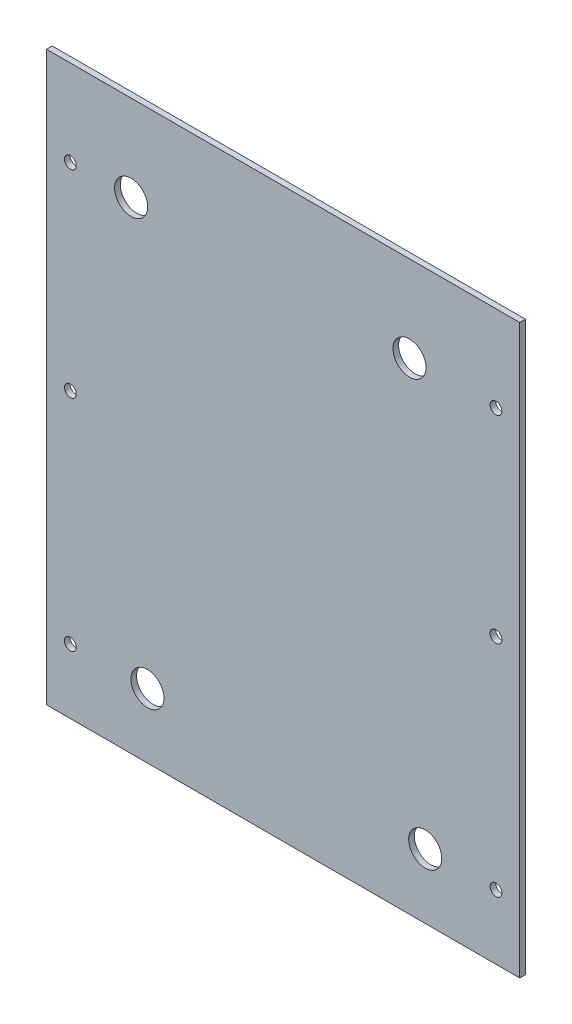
ISO-10303-21;
HEADER;
FILE_DESCRIPTION(('STEP AP214'),'2;1');
FILE_NAME('part.step','',(''),(''),'','','');
FILE_SCHEMA(('AUTOMOTIVE_DESIGN { 1 0 10303 214 1 1 1 1 }'));
ENDSEC;
DATA;
#1=APPLICATION_CONTEXT('core data for automotive mechanical design processes');
#2=APPLICATION_PROTOCOL_DEFINITION('international standard','automotive_design',2000,#1);
#3=PRODUCT_CONTEXT('',#1,'mechanical');
#4=PRODUCT('Part','Part','',(#3));
#5=PRODUCT_RELATED_PRODUCT_CATEGORY('part','',(#4));
#6=PRODUCT_DEFINITION_FORMATION('','',#4);
#7=PRODUCT_DEFINITION_CONTEXT('part definition',#1,'design');
#8=PRODUCT_DEFINITION('design','',#6,#7);
#9=PRODUCT_DEFINITION_SHAPE('','',#8);
#10=(LENGTH_UNIT() NAMED_UNIT(*) SI_UNIT(.MILLI.,.METRE.));
#11=(NAMED_UNIT(*) PLANE_ANGLE_UNIT() SI_UNIT($,.RADIAN.));
#12=(NAMED_UNIT(*) SI_UNIT($,.STERADIAN.) SOLID_ANGLE_UNIT());
#13=UNCERTAINTY_MEASURE_WITH_UNIT(LENGTH_MEASURE(1.E-05),#10,'distance_accuracy_value','');
#14=(GEOMETRIC_REPRESENTATION_CONTEXT(3) GLOBAL_UNCERTAINTY_ASSIGNED_CONTEXT((#13)) GLOBAL_UNIT_ASSIGNED_CONTEXT((#10,
#11,#12)) REPRESENTATION_CONTEXT('',''));
#15=CARTESIAN_POINT('',(0.,0.,0.));
#16=DIRECTION('',(0.,0.,1.));
#17=DIRECTION('',(1.,0.,0.));
#18=AXIS2_PLACEMENT_3D('',#15,#16,#17);
#19=CARTESIAN_POINT('',(0.,0.,3.048));
#20=DIRECTION('',(0.,0.,-1.));
#21=DIRECTION('',(-1.,0.,0.));
#22=AXIS2_PLACEMENT_3D('',#19,#20,#21);
#23=PLANE('',#22);
#24=DIRECTION('',(0.,1.,0.));
#25=VECTOR('',#24,1.);
#26=CARTESIAN_POINT('',(127.,-152.4,3.048));
#27=LINE('',#26,#25);
#28=CARTESIAN_POINT('',(127.,-152.4,3.048));
#29=VERTEX_POINT('',#28);
#30=CARTESIAN_POINT('',(127.,152.4,3.048));
#31=VERTEX_POINT('',#30);
#32=EDGE_CURVE('E98',#29,#31,#27,.T.);
#33=ORIENTED_EDGE('',*,*,#32,.T.);
#34=DIRECTION('',(-1.,0.,0.));
#35=VECTOR('',#34,1.);
#36=CARTESIAN_POINT('',(-127.,152.4,3.048));
#37=LINE('',#36,#35);
#38=CARTESIAN_POINT('',(-127.,152.4,3.048));
#39=VERTEX_POINT('',#38);
#40=EDGE_CURVE('E93',#31,#39,#37,.T.);
#41=ORIENTED_EDGE('',*,*,#40,.T.);
#42=DIRECTION('',(0.,-1.,0.));
#43=VECTOR('',#42,1.);
#44=CARTESIAN_POINT('',(-127.,-152.4,3.048));
#45=LINE('',#44,#43);
#46=CARTESIAN_POINT('',(-127.,-152.4,3.048));
#47=VERTEX_POINT('',#46);
#48=EDGE_CURVE('E96',#39,#47,#45,.T.);
#49=ORIENTED_EDGE('',*,*,#48,.T.);
#50=DIRECTION('',(1.,0.,0.));
#51=VECTOR('',#50,1.);
#52=CARTESIAN_POINT('',(-127.,-152.4,3.048));
#53=LINE('',#52,#51);
#54=EDGE_CURVE('E63',#47,#29,#53,.T.);
#55=ORIENTED_EDGE('',*,*,#54,.T.);
#56=EDGE_LOOP('',(#33,#41,#49,#55));
#57=FACE_BOUND('',#56,.T.);
#58=CARTESIAN_POINT('',(-114.255930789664,106.235502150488,3.048));
#59=DIRECTION('',(0.,0.,1.));
#60=DIRECTION('',(1.,0.,0.));
#61=AXIS2_PLACEMENT_3D('',#58,#59,#60);
#62=CIRCLE('',#61,3.175);
#63=CARTESIAN_POINT('',(-117.430930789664,106.235502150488,3.048));
#64=VERTEX_POINT('',#63);
#65=EDGE_CURVE('E118',#64,#64,#62,.T.);
#66=ORIENTED_EDGE('',*,*,#65,.F.);
#67=EDGE_LOOP('',(#66));
#68=FACE_BOUND('',#67,.T.);
#69=CARTESIAN_POINT('',(-114.255930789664,0.,3.048));
#70=DIRECTION('',(0.,0.,1.));
#71=DIRECTION('',(1.,0.,0.));
#72=AXIS2_PLACEMENT_3D('',#69,#70,#71);
#73=CIRCLE('',#72,3.175);
#74=CARTESIAN_POINT('',(-117.430930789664,0.,3.048));
#75=VERTEX_POINT('',#74);
#76=EDGE_CURVE('E140',#75,#75,#73,.T.);
#77=ORIENTED_EDGE('',*,*,#76,.F.);
#78=EDGE_LOOP('',(#77));
#79=FACE_BOUND('',#78,.T.);
#80=CARTESIAN_POINT('',(-114.255930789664,-117.773662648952,3.048));
#81=DIRECTION('',(0.,0.,1.));
#82=DIRECTION('',(1.,0.,0.));
#83=AXIS2_PLACEMENT_3D('',#80,#81,#82);
#84=CIRCLE('',#83,3.175);
#85=CARTESIAN_POINT('',(-117.430930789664,-117.773662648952,3.048));
#86=VERTEX_POINT('',#85);
#87=EDGE_CURVE('E148',#86,#86,#84,.T.);
#88=ORIENTED_EDGE('',*,*,#87,.F.);
#89=EDGE_LOOP('',(#88));
#90=FACE_BOUND('',#89,.T.);
#91=CARTESIAN_POINT('',(114.255930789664,-117.773662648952,3.048));
#92=DIRECTION('',(0.,0.,1.));
#93=DIRECTION('',(-1.,0.,0.));
#94=AXIS2_PLACEMENT_3D('',#91,#92,#93);
#95=CIRCLE('',#94,3.175);
#96=CARTESIAN_POINT('',(111.080930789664,-117.773662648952,3.048));
#97=VERTEX_POINT('',#96);
#98=EDGE_CURVE('E156',#97,#97,#95,.T.);
#99=ORIENTED_EDGE('',*,*,#98,.F.);
#100=EDGE_LOOP('',(#99));
#101=FACE_BOUND('',#100,.T.);
#102=CARTESIAN_POINT('',(114.255930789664,1.66533453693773E-13,3.048));
#103=DIRECTION('',(0.,0.,1.));
#104=DIRECTION('',(-1.,0.,0.));
#105=AXIS2_PLACEMENT_3D('',#102,#103,#104);
#106=CIRCLE('',#105,3.175);
#107=CARTESIAN_POINT('',(111.080930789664,1.66533453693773E-13,3.048));
#108=VERTEX_POINT('',#107);
#109=EDGE_CURVE('E164',#108,#108,#106,.T.);
#110=ORIENTED_EDGE('',*,*,#109,.F.);
#111=EDGE_LOOP('',(#110));
#112=FACE_BOUND('',#111,.T.);
#113=CARTESIAN_POINT('',(114.255930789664,106.235502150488,3.048));
#114=DIRECTION('',(0.,0.,1.));
#115=DIRECTION('',(-1.,0.,0.));
#116=AXIS2_PLACEMENT_3D('',#113,#114,#115);
#117=CIRCLE('',#116,3.175);
#118=CARTESIAN_POINT('',(111.080930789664,106.235502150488,3.048));
#119=VERTEX_POINT('',#118);
#120=EDGE_CURVE('E172',#119,#119,#117,.T.);
#121=ORIENTED_EDGE('',*,*,#120,.F.);
#122=EDGE_LOOP('',(#121));
#123=FACE_BOUND('',#122,.T.);
#124=CARTESIAN_POINT('',(-81.6113791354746,106.235502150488,3.048));
#125=DIRECTION('',(0.,0.,1.));
#126=DIRECTION('',(1.,0.,0.));
#127=AXIS2_PLACEMENT_3D('',#124,#125,#126);
#128=CIRCLE('',#127,8.88999999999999);
#129=CARTESIAN_POINT('',(-90.5013791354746,106.235502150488,3.048));
#130=VERTEX_POINT('',#129);
#131=EDGE_CURVE('E180',#130,#130,#128,.T.);
#132=ORIENTED_EDGE('',*,*,#131,.F.);
#133=EDGE_LOOP('',(#132));
#134=FACE_BOUND('',#133,.T.);
#135=CARTESIAN_POINT('',(67.8218702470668,106.235502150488,3.048));
#136=DIRECTION('',(0.,0.,1.));
#137=DIRECTION('',(1.,0.,0.));
#138=AXIS2_PLACEMENT_3D('',#135,#136,#137);
#139=CIRCLE('',#138,8.88999999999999);
#140=CARTESIAN_POINT('',(58.9318702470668,106.235502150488,3.048));
#141=VERTEX_POINT('',#140);
#142=EDGE_CURVE('E188',#141,#141,#139,.T.);
#143=ORIENTED_EDGE('',*,*,#142,.F.);
#144=EDGE_LOOP('',(#143));
#145=FACE_BOUND('',#144,.T.);
#146=CARTESIAN_POINT('',(-72.8692669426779,-117.773662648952,3.048));
#147=DIRECTION('',(0.,0.,1.));
#148=DIRECTION('',(1.,0.,0.));
#149=AXIS2_PLACEMENT_3D('',#146,#147,#148);
#150=CIRCLE('',#149,8.88999999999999);
#151=CARTESIAN_POINT('',(-81.7592669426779,-117.773662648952,3.048));
#152=VERTEX_POINT('',#151);
#153=EDGE_CURVE('E196',#152,#152,#150,.T.);
#154=ORIENTED_EDGE('',*,*,#153,.F.);
#155=EDGE_LOOP('',(#154));
#156=FACE_BOUND('',#155,.T.);
#157=CARTESIAN_POINT('',(76.2644267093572,-117.773662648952,3.048));
#158=DIRECTION('',(0.,0.,1.));
#159=DIRECTION('',(1.,0.,0.));
#160=AXIS2_PLACEMENT_3D('',#157,#158,#159);
#161=CIRCLE('',#160,8.88999999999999);
#162=CARTESIAN_POINT('',(67.3744267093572,-117.773662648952,3.048));
#163=VERTEX_POINT('',#162);
#164=EDGE_CURVE('E204',#163,#163,#161,.T.);
#165=ORIENTED_EDGE('',*,*,#164,.F.);
#166=EDGE_LOOP('',(#165));
#167=FACE_BOUND('',#166,.T.);
#168=ADVANCED_FACE('F45',(#57,#68,#79,#90,#101,#112,#123,#134,#145,#156,#167),#23,.F.);
#169=CARTESIAN_POINT('',(0.,0.,0.));
#170=DIRECTION('',(0.,0.,-1.));
#171=DIRECTION('',(-1.,0.,0.));
#172=AXIS2_PLACEMENT_3D('',#169,#170,#171);
#173=PLANE('',#172);
#174=CARTESIAN_POINT('',(-72.8692669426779,-117.773662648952,0.));
#175=DIRECTION('',(0.,0.,1.));
#176=DIRECTION('',(1.,0.,0.));
#177=AXIS2_PLACEMENT_3D('',#174,#175,#176);
#178=CIRCLE('',#177,8.88999999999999);
#179=CARTESIAN_POINT('',(-81.7592669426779,-117.773662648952,0.));
#180=VERTEX_POINT('',#179);
#181=EDGE_CURVE('E200',#180,#180,#178,.T.);
#182=ORIENTED_EDGE('',*,*,#181,.T.);
#183=EDGE_LOOP('',(#182));
#184=FACE_BOUND('',#183,.T.);
#185=CARTESIAN_POINT('',(-81.6113791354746,106.235502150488,0.));
#186=DIRECTION('',(0.,0.,1.));
#187=DIRECTION('',(1.,0.,0.));
#188=AXIS2_PLACEMENT_3D('',#185,#186,#187);
#189=CIRCLE('',#188,8.88999999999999);
#190=CARTESIAN_POINT('',(-90.5013791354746,106.235502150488,0.));
#191=VERTEX_POINT('',#190);
#192=EDGE_CURVE('E184',#191,#191,#189,.T.);
#193=ORIENTED_EDGE('',*,*,#192,.T.);
#194=EDGE_LOOP('',(#193));
#195=FACE_BOUND('',#194,.T.);
#196=CARTESIAN_POINT('',(114.255930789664,1.66533453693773E-13,0.));
#197=DIRECTION('',(0.,0.,1.));
#198=DIRECTION('',(-1.,0.,0.));
#199=AXIS2_PLACEMENT_3D('',#196,#197,#198);
#200=CIRCLE('',#199,3.175);
#201=CARTESIAN_POINT('',(111.080930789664,1.66533453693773E-13,0.));
#202=VERTEX_POINT('',#201);
#203=EDGE_CURVE('E168',#202,#202,#200,.T.);
#204=ORIENTED_EDGE('',*,*,#203,.T.);
#205=EDGE_LOOP('',(#204));
#206=FACE_BOUND('',#205,.T.);
#207=CARTESIAN_POINT('',(-114.255930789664,-117.773662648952,0.));
#208=DIRECTION('',(0.,0.,1.));
#209=DIRECTION('',(1.,0.,0.));
#210=AXIS2_PLACEMENT_3D('',#207,#208,#209);
#211=CIRCLE('',#210,3.175);
#212=CARTESIAN_POINT('',(-117.430930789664,-117.773662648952,0.));
#213=VERTEX_POINT('',#212);
#214=EDGE_CURVE('E152',#213,#213,#211,.T.);
#215=ORIENTED_EDGE('',*,*,#214,.T.);
#216=EDGE_LOOP('',(#215));
#217=FACE_BOUND('',#216,.T.);
#218=CARTESIAN_POINT('',(-114.255930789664,106.235502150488,0.));
#219=DIRECTION('',(0.,0.,1.));
#220=DIRECTION('',(1.,0.,0.));
#221=AXIS2_PLACEMENT_3D('',#218,#219,#220);
#222=CIRCLE('',#221,3.175);
#223=CARTESIAN_POINT('',(-117.430930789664,106.235502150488,0.));
#224=VERTEX_POINT('',#223);
#225=EDGE_CURVE('E136',#224,#224,#222,.T.);
#226=ORIENTED_EDGE('',*,*,#225,.T.);
#227=EDGE_LOOP('',(#226));
#228=FACE_BOUND('',#227,.T.);
#229=DIRECTION('',(0.,1.,0.));
#230=VECTOR('',#229,1.);
#231=CARTESIAN_POINT('',(127.,-152.4,0.));
#232=LINE('',#231,#230);
#233=CARTESIAN_POINT('',(127.,-152.4,0.));
#234=VERTEX_POINT('',#233);
#235=CARTESIAN_POINT('',(127.,152.4,0.));
#236=VERTEX_POINT('',#235);
#237=EDGE_CURVE('E114',#234,#236,#232,.T.);
#238=ORIENTED_EDGE('',*,*,#237,.F.);
#239=DIRECTION('',(1.,0.,0.));
#240=VECTOR('',#239,1.);
#241=CARTESIAN_POINT('',(-127.,-152.4,0.));
#242=LINE('',#241,#240);
#243=CARTESIAN_POINT('',(-127.,-152.4,0.));
#244=VERTEX_POINT('',#243);
#245=EDGE_CURVE('E86',#244,#234,#242,.T.);
#246=ORIENTED_EDGE('',*,*,#245,.F.);
#247=DIRECTION('',(0.,-1.,0.));
#248=VECTOR('',#247,1.);
#249=CARTESIAN_POINT('',(-127.,-152.4,0.));
#250=LINE('',#249,#248);
#251=CARTESIAN_POINT('',(-127.,152.4,0.));
#252=VERTEX_POINT('',#251);
#253=EDGE_CURVE('E80',#252,#244,#250,.T.);
#254=ORIENTED_EDGE('',*,*,#253,.F.);
#255=DIRECTION('',(-1.,0.,0.));
#256=VECTOR('',#255,1.);
#257=CARTESIAN_POINT('',(-127.,152.4,0.));
#258=LINE('',#257,#256);
#259=EDGE_CURVE('E103',#236,#252,#258,.T.);
#260=ORIENTED_EDGE('',*,*,#259,.F.);
#261=EDGE_LOOP('',(#238,#246,#254,#260));
#262=FACE_BOUND('',#261,.T.);
#263=CARTESIAN_POINT('',(-114.255930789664,0.,0.));
#264=DIRECTION('',(0.,0.,1.));
#265=DIRECTION('',(1.,0.,0.));
#266=AXIS2_PLACEMENT_3D('',#263,#264,#265);
#267=CIRCLE('',#266,3.175);
#268=CARTESIAN_POINT('',(-117.430930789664,0.,0.));
#269=VERTEX_POINT('',#268);
#270=EDGE_CURVE('E144',#269,#269,#267,.T.);
#271=ORIENTED_EDGE('',*,*,#270,.T.);
#272=EDGE_LOOP('',(#271));
#273=FACE_BOUND('',#272,.T.);
#274=CARTESIAN_POINT('',(114.255930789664,-117.773662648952,0.));
#275=DIRECTION('',(0.,0.,1.));
#276=DIRECTION('',(-1.,0.,0.));
#277=AXIS2_PLACEMENT_3D('',#274,#275,#276);
#278=CIRCLE('',#277,3.175);
#279=CARTESIAN_POINT('',(111.080930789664,-117.773662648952,0.));
#280=VERTEX_POINT('',#279);
#281=EDGE_CURVE('E160',#280,#280,#278,.T.);
#282=ORIENTED_EDGE('',*,*,#281,.T.);
#283=EDGE_LOOP('',(#282));
#284=FACE_BOUND('',#283,.T.);
#285=CARTESIAN_POINT('',(114.255930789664,106.235502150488,0.));
#286=DIRECTION('',(0.,0.,1.));
#287=DIRECTION('',(-1.,0.,0.));
#288=AXIS2_PLACEMENT_3D('',#285,#286,#287);
#289=CIRCLE('',#288,3.175);
#290=CARTESIAN_POINT('',(111.080930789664,106.235502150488,0.));
#291=VERTEX_POINT('',#290);
#292=EDGE_CURVE('E176',#291,#291,#289,.T.);
#293=ORIENTED_EDGE('',*,*,#292,.T.);
#294=EDGE_LOOP('',(#293));
#295=FACE_BOUND('',#294,.T.);
#296=CARTESIAN_POINT('',(67.8218702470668,106.235502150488,0.));
#297=DIRECTION('',(0.,0.,1.));
#298=DIRECTION('',(1.,0.,0.));
#299=AXIS2_PLACEMENT_3D('',#296,#297,#298);
#300=CIRCLE('',#299,8.88999999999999);
#301=CARTESIAN_POINT('',(58.9318702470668,106.235502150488,0.));
#302=VERTEX_POINT('',#301);
#303=EDGE_CURVE('E192',#302,#302,#300,.T.);
#304=ORIENTED_EDGE('',*,*,#303,.T.);
#305=EDGE_LOOP('',(#304));
#306=FACE_BOUND('',#305,.T.);
#307=CARTESIAN_POINT('',(76.2644267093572,-117.773662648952,0.));
#308=DIRECTION('',(0.,0.,1.));
#309=DIRECTION('',(1.,0.,0.));
#310=AXIS2_PLACEMENT_3D('',#307,#308,#309);
#311=CIRCLE('',#310,8.88999999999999);
#312=CARTESIAN_POINT('',(67.3744267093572,-117.773662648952,0.));
#313=VERTEX_POINT('',#312);
#314=EDGE_CURVE('E208',#313,#313,#311,.T.);
#315=ORIENTED_EDGE('',*,*,#314,.T.);
#316=EDGE_LOOP('',(#315));
#317=FACE_BOUND('',#316,.T.);
#318=ADVANCED_FACE('F131',(#184,#195,#206,#217,#228,#262,#273,#284,#295,#306,#317),#173,.T.);
#319=CARTESIAN_POINT('',(127.,-152.4,3.048));
#320=DIRECTION('',(-1.,0.,0.));
#321=DIRECTION('',(0.,0.,1.));
#322=AXIS2_PLACEMENT_3D('',#319,#320,#321);
#323=PLANE('',#322);
#324=ORIENTED_EDGE('',*,*,#237,.T.);
#325=DIRECTION('',(0.,0.,-1.));
#326=VECTOR('',#325,1.);
#327=CARTESIAN_POINT('',(127.,152.4,3.048));
#328=LINE('',#327,#326);
#329=EDGE_CURVE('E11',#31,#236,#328,.T.);
#330=ORIENTED_EDGE('',*,*,#329,.F.);
#331=ORIENTED_EDGE('',*,*,#32,.F.);
#332=DIRECTION('',(0.,0.,-1.));
#333=VECTOR('',#332,1.);
#334=CARTESIAN_POINT('',(127.,-152.4,3.048));
#335=LINE('',#334,#333);
#336=EDGE_CURVE('E110',#29,#234,#335,.T.);
#337=ORIENTED_EDGE('',*,*,#336,.T.);
#338=EDGE_LOOP('',(#324,#330,#331,#337));
#339=FACE_BOUND('',#338,.T.);
#340=ADVANCED_FACE('F47',(#339),#323,.F.);
#341=CARTESIAN_POINT('',(-127.,152.4,3.048));
#342=DIRECTION('',(0.,-1.,0.));
#343=DIRECTION('',(0.,0.,-1.));
#344=AXIS2_PLACEMENT_3D('',#341,#342,#343);
#345=PLANE('',#344);
#346=ORIENTED_EDGE('',*,*,#259,.T.);
#347=DIRECTION('',(0.,0.,-1.));
#348=VECTOR('',#347,1.);
#349=CARTESIAN_POINT('',(-127.,152.4,3.048));
#350=LINE('',#349,#348);
#351=EDGE_CURVE('E55',#39,#252,#350,.T.);
#352=ORIENTED_EDGE('',*,*,#351,.F.);
#353=ORIENTED_EDGE('',*,*,#40,.F.);
#354=ORIENTED_EDGE('',*,*,#329,.T.);
#355=EDGE_LOOP('',(#346,#352,#353,#354));
#356=FACE_BOUND('',#355,.T.);
#357=ADVANCED_FACE('F102',(#356),#345,.F.);
#358=CARTESIAN_POINT('',(-127.,-152.4,3.048));
#359=DIRECTION('',(1.,0.,0.));
#360=DIRECTION('',(0.,0.,-1.));
#361=AXIS2_PLACEMENT_3D('',#358,#359,#360);
#362=PLANE('',#361);
#363=ORIENTED_EDGE('',*,*,#253,.T.);
#364=DIRECTION('',(0.,0.,-1.));
#365=VECTOR('',#364,1.);
#366=CARTESIAN_POINT('',(-127.,-152.4,3.048));
#367=LINE('',#366,#365);
#368=EDGE_CURVE('E105',#47,#244,#367,.T.);
#369=ORIENTED_EDGE('',*,*,#368,.F.);
#370=ORIENTED_EDGE('',*,*,#48,.F.);
#371=ORIENTED_EDGE('',*,*,#351,.T.);
#372=EDGE_LOOP('',(#363,#369,#370,#371));
#373=FACE_BOUND('',#372,.T.);
#374=ADVANCED_FACE('F106',(#373),#362,.F.);
#375=CARTESIAN_POINT('',(-127.,-152.4,3.048));
#376=DIRECTION('',(0.,1.,0.));
#377=DIRECTION('',(0.,0.,1.));
#378=AXIS2_PLACEMENT_3D('',#375,#376,#377);
#379=PLANE('',#378);
#380=ORIENTED_EDGE('',*,*,#245,.T.);
#381=ORIENTED_EDGE('',*,*,#336,.F.);
#382=ORIENTED_EDGE('',*,*,#54,.F.);
#383=ORIENTED_EDGE('',*,*,#368,.T.);
#384=EDGE_LOOP('',(#380,#381,#382,#383));
#385=FACE_BOUND('',#384,.T.);
#386=ADVANCED_FACE('F128',(#385),#379,.F.);
#387=CARTESIAN_POINT('',(-114.255930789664,106.235502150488,3.048));
#388=DIRECTION('',(0.,0.,-1.));
#389=DIRECTION('',(-1.,0.,0.));
#390=AXIS2_PLACEMENT_3D('',#387,#388,#389);
#391=CYLINDRICAL_SURFACE('',#390,3.175);
#392=CARTESIAN_POINT('',(-117.430930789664,106.235502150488,3.048));
#393=CARTESIAN_POINT('',(-117.430930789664,106.235502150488,3.01625));
#394=CARTESIAN_POINT('',(-117.430930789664,106.235502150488,2.9845));
#395=CARTESIAN_POINT('',(-117.430930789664,106.235502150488,2.921));
#396=CARTESIAN_POINT('',(-117.430930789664,106.235502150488,2.88925));
#397=CARTESIAN_POINT('',(-117.430930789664,106.235502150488,2.82575));
#398=CARTESIAN_POINT('',(-117.430930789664,106.235502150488,2.794));
#399=CARTESIAN_POINT('',(-117.430930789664,106.235502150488,2.7305));
#400=CARTESIAN_POINT('',(-117.430930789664,106.235502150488,2.69875));
#401=CARTESIAN_POINT('',(-117.430930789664,106.235502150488,2.63525));
#402=CARTESIAN_POINT('',(-117.430930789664,106.235502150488,2.6035));
#403=CARTESIAN_POINT('',(-117.430930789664,106.235502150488,2.54));
#404=CARTESIAN_POINT('',(-117.430930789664,106.235502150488,2.50825));
#405=CARTESIAN_POINT('',(-117.430930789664,106.235502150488,2.44475));
#406=CARTESIAN_POINT('',(-117.430930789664,106.235502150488,2.413));
#407=CARTESIAN_POINT('',(-117.430930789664,106.235502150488,2.3495));
#408=CARTESIAN_POINT('',(-117.430930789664,106.235502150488,2.31775));
#409=CARTESIAN_POINT('',(-117.430930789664,106.235502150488,2.25425));
#410=CARTESIAN_POINT('',(-117.430930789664,106.235502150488,2.2225));
#411=CARTESIAN_POINT('',(-117.430930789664,106.235502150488,2.159));
#412=CARTESIAN_POINT('',(-117.430930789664,106.235502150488,2.12725));
#413=CARTESIAN_POINT('',(-117.430930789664,106.235502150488,2.06375));
#414=CARTESIAN_POINT('',(-117.430930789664,106.235502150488,2.032));
#415=CARTESIAN_POINT('',(-117.430930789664,106.235502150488,1.9685));
#416=CARTESIAN_POINT('',(-117.430930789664,106.235502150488,1.93675));
#417=CARTESIAN_POINT('',(-117.430930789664,106.235502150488,1.87325));
#418=CARTESIAN_POINT('',(-117.430930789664,106.235502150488,1.8415));
#419=CARTESIAN_POINT('',(-117.430930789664,106.235502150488,1.778));
#420=CARTESIAN_POINT('',(-117.430930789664,106.235502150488,1.74625));
#421=CARTESIAN_POINT('',(-117.430930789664,106.235502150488,1.68275));
#422=CARTESIAN_POINT('',(-117.430930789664,106.235502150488,1.651));
#423=CARTESIAN_POINT('',(-117.430930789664,106.235502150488,1.5875));
#424=CARTESIAN_POINT('',(-117.430930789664,106.235502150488,1.55575));
#425=CARTESIAN_POINT('',(-117.430930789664,106.235502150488,1.49225));
#426=CARTESIAN_POINT('',(-117.430930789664,106.235502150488,1.4605));
#427=CARTESIAN_POINT('',(-117.430930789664,106.235502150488,1.397));
#428=CARTESIAN_POINT('',(-117.430930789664,106.235502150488,1.36525));
#429=CARTESIAN_POINT('',(-117.430930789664,106.235502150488,1.30175));
#430=CARTESIAN_POINT('',(-117.430930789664,106.235502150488,1.27));
#431=CARTESIAN_POINT('',(-117.430930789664,106.235502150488,1.2065));
#432=CARTESIAN_POINT('',(-117.430930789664,106.235502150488,1.17475));
#433=CARTESIAN_POINT('',(-117.430930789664,106.235502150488,1.11125));
#434=CARTESIAN_POINT('',(-117.430930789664,106.235502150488,1.0795));
#435=CARTESIAN_POINT('',(-117.430930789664,106.235502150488,1.016));
#436=CARTESIAN_POINT('',(-117.430930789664,106.235502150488,0.98425));
#437=CARTESIAN_POINT('',(-117.430930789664,106.235502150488,0.92075));
#438=CARTESIAN_POINT('',(-117.430930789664,106.235502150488,0.889));
#439=CARTESIAN_POINT('',(-117.430930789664,106.235502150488,0.8255));
#440=CARTESIAN_POINT('',(-117.430930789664,106.235502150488,0.79375));
#441=CARTESIAN_POINT('',(-117.430930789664,106.235502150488,0.73025));
#442=CARTESIAN_POINT('',(-117.430930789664,106.235502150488,0.6985));
#443=CARTESIAN_POINT('',(-117.430930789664,106.235502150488,0.635));
#444=CARTESIAN_POINT('',(-117.430930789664,106.235502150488,0.60325));
#445=CARTESIAN_POINT('',(-117.430930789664,106.235502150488,0.53975));
#446=CARTESIAN_POINT('',(-117.430930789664,106.235502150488,0.508));
#447=CARTESIAN_POINT('',(-117.430930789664,106.235502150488,0.4445));
#448=CARTESIAN_POINT('',(-117.430930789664,106.235502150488,0.41275));
#449=CARTESIAN_POINT('',(-117.430930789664,106.235502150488,0.34925));
#450=CARTESIAN_POINT('',(-117.430930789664,106.235502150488,0.3175));
#451=CARTESIAN_POINT('',(-117.430930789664,106.235502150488,0.254));
#452=CARTESIAN_POINT('',(-117.430930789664,106.235502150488,0.22225));
#453=CARTESIAN_POINT('',(-117.430930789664,106.235502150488,0.15875));
#454=CARTESIAN_POINT('',(-117.430930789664,106.235502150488,0.127));
#455=CARTESIAN_POINT('',(-117.430930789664,106.235502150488,0.0634999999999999));
#456=CARTESIAN_POINT('',(-117.430930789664,106.235502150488,0.03175));
#457=CARTESIAN_POINT('',(-117.430930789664,106.235502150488,0.));
#458=B_SPLINE_CURVE_WITH_KNOTS('',3,(#392,#393,#394,#395,#396,#397,#398,#399,#400,#401,#402,
#403,#404,#405,#406,#407,#408,#409,#410,#411,#412,#413,#414,#415,#416,#417,#418,#419,#420,#421,
#422,#423,#424,#425,#426,#427,#428,#429,#430,#431,#432,#433,#434,#435,#436,#437,#438,#439,#440,
#441,#442,#443,#444,#445,#446,#447,#448,#449,#450,#451,#452,#453,#454,#455,#456,#457),
.UNSPECIFIED.,.F.,.F.,(4,2,2,2,2,2,2,2,2,2,2,2,2,2,2,2,2,2,2,2,2,2,2,2,2,2,2,2,2,2,2,2,4),(0.,
0.0952500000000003,0.1905,0.28575,0.381,0.47625,0.5715,0.66675,0.762,0.85725,0.9525,1.04775,
1.143,1.23825,1.3335,1.42875,1.524,1.61925,1.7145,1.80975,1.905,2.00025,2.0955,2.19075,2.286,
2.38125,2.4765,2.57175,2.667,2.76225,2.8575,2.95275,3.048),.UNSPECIFIED.);
#459=EDGE_CURVE('BSEAM227',#64,#224,#458,.T.);
#460=ORIENTED_EDGE('',*,*,#65,.T.);
#461=ORIENTED_EDGE('',*,*,#225,.F.);
#462=ORIENTED_EDGE('',*,*,#459,.T.);
#463=ORIENTED_EDGE('',*,*,#459,.F.);
#464=EDGE_LOOP('',(#460,#462,#461,#463));
#465=FACE_BOUND('',#464,.T.);
#466=ADVANCED_FACE('F227',(#465),#391,.F.);
#467=CARTESIAN_POINT('',(-114.255930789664,0.,3.048));
#468=DIRECTION('',(0.,0.,-1.));
#469=DIRECTION('',(-1.,0.,0.));
#470=AXIS2_PLACEMENT_3D('',#467,#468,#469);
#471=CYLINDRICAL_SURFACE('',#470,3.175);
#472=CARTESIAN_POINT('',(-117.430930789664,0.,3.048));
#473=CARTESIAN_POINT('',(-117.430930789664,0.,3.01625));
#474=CARTESIAN_POINT('',(-117.430930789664,0.,2.9845));
#475=CARTESIAN_POINT('',(-117.430930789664,0.,2.921));
#476=CARTESIAN_POINT('',(-117.430930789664,0.,2.88925));
#477=CARTESIAN_POINT('',(-117.430930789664,0.,2.82575));
#478=CARTESIAN_POINT('',(-117.430930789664,0.,2.794));
#479=CARTESIAN_POINT('',(-117.430930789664,0.,2.7305));
#480=CARTESIAN_POINT('',(-117.430930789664,0.,2.69875));
#481=CARTESIAN_POINT('',(-117.430930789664,0.,2.63525));
#482=CARTESIAN_POINT('',(-117.430930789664,0.,2.6035));
#483=CARTESIAN_POINT('',(-117.430930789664,0.,2.54));
#484=CARTESIAN_POINT('',(-117.430930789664,0.,2.50825));
#485=CARTESIAN_POINT('',(-117.430930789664,0.,2.44475));
#486=CARTESIAN_POINT('',(-117.430930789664,0.,2.413));
#487=CARTESIAN_POINT('',(-117.430930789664,0.,2.3495));
#488=CARTESIAN_POINT('',(-117.430930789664,0.,2.31775));
#489=CARTESIAN_POINT('',(-117.430930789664,0.,2.25425));
#490=CARTESIAN_POINT('',(-117.430930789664,0.,2.2225));
#491=CARTESIAN_POINT('',(-117.430930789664,0.,2.159));
#492=CARTESIAN_POINT('',(-117.430930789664,0.,2.12725));
#493=CARTESIAN_POINT('',(-117.430930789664,0.,2.06375));
#494=CARTESIAN_POINT('',(-117.430930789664,0.,2.032));
#495=CARTESIAN_POINT('',(-117.430930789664,0.,1.9685));
#496=CARTESIAN_POINT('',(-117.430930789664,0.,1.93675));
#497=CARTESIAN_POINT('',(-117.430930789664,0.,1.87325));
#498=CARTESIAN_POINT('',(-117.430930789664,0.,1.8415));
#499=CARTESIAN_POINT('',(-117.430930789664,0.,1.778));
#500=CARTESIAN_POINT('',(-117.430930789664,0.,1.74625));
#501=CARTESIAN_POINT('',(-117.430930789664,0.,1.68275));
#502=CARTESIAN_POINT('',(-117.430930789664,0.,1.651));
#503=CARTESIAN_POINT('',(-117.430930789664,0.,1.5875));
#504=CARTESIAN_POINT('',(-117.430930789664,0.,1.55575));
#505=CARTESIAN_POINT('',(-117.430930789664,0.,1.49225));
#506=CARTESIAN_POINT('',(-117.430930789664,0.,1.4605));
#507=CARTESIAN_POINT('',(-117.430930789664,0.,1.397));
#508=CARTESIAN_POINT('',(-117.430930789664,0.,1.36525));
#509=CARTESIAN_POINT('',(-117.430930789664,0.,1.30175));
#510=CARTESIAN_POINT('',(-117.430930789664,0.,1.27));
#511=CARTESIAN_POINT('',(-117.430930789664,0.,1.2065));
#512=CARTESIAN_POINT('',(-117.430930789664,0.,1.17475));
#513=CARTESIAN_POINT('',(-117.430930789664,0.,1.11125));
#514=CARTESIAN_POINT('',(-117.430930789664,0.,1.0795));
#515=CARTESIAN_POINT('',(-117.430930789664,0.,1.016));
#516=CARTESIAN_POINT('',(-117.430930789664,0.,0.98425));
#517=CARTESIAN_POINT('',(-117.430930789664,0.,0.92075));
#518=CARTESIAN_POINT('',(-117.430930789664,0.,0.889));
#519=CARTESIAN_POINT('',(-117.430930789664,0.,0.8255));
#520=CARTESIAN_POINT('',(-117.430930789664,0.,0.79375));
#521=CARTESIAN_POINT('',(-117.430930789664,0.,0.73025));
#522=CARTESIAN_POINT('',(-117.430930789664,0.,0.6985));
#523=CARTESIAN_POINT('',(-117.430930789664,0.,0.635));
#524=CARTESIAN_POINT('',(-117.430930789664,0.,0.60325));
#525=CARTESIAN_POINT('',(-117.430930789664,0.,0.53975));
#526=CARTESIAN_POINT('',(-117.430930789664,0.,0.508));
#527=CARTESIAN_POINT('',(-117.430930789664,0.,0.4445));
#528=CARTESIAN_POINT('',(-117.430930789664,0.,0.41275));
#529=CARTESIAN_POINT('',(-117.430930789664,0.,0.34925));
#530=CARTESIAN_POINT('',(-117.430930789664,0.,0.3175));
#531=CARTESIAN_POINT('',(-117.430930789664,0.,0.254));
#532=CARTESIAN_POINT('',(-117.430930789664,0.,0.22225));
#533=CARTESIAN_POINT('',(-117.430930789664,0.,0.15875));
#534=CARTESIAN_POINT('',(-117.430930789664,0.,0.127));
#535=CARTESIAN_POINT('',(-117.430930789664,0.,0.0634999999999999));
#536=CARTESIAN_POINT('',(-117.430930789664,0.,0.03175));
#537=CARTESIAN_POINT('',(-117.430930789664,0.,0.));
#538=B_SPLINE_CURVE_WITH_KNOTS('',3,(#472,#473,#474,#475,#476,#477,#478,#479,#480,#481,#482,
#483,#484,#485,#486,#487,#488,#489,#490,#491,#492,#493,#494,#495,#496,#497,#498,#499,#500,#501,
#502,#503,#504,#505,#506,#507,#508,#509,#510,#511,#512,#513,#514,#515,#516,#517,#518,#519,#520,
#521,#522,#523,#524,#525,#526,#527,#528,#529,#530,#531,#532,#533,#534,#535,#536,#537),
.UNSPECIFIED.,.F.,.F.,(4,2,2,2,2,2,2,2,2,2,2,2,2,2,2,2,2,2,2,2,2,2,2,2,2,2,2,2,2,2,2,2,4),(0.,
0.0952500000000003,0.1905,0.28575,0.381,0.47625,0.5715,0.66675,0.762,0.85725,0.9525,1.04775,
1.143,1.23825,1.3335,1.42875,1.524,1.61925,1.7145,1.80975,1.905,2.00025,2.0955,2.19075,2.286,
2.38125,2.4765,2.57175,2.667,2.76225,2.8575,2.95275,3.048),.UNSPECIFIED.);
#539=EDGE_CURVE('BSEAM272',#75,#269,#538,.T.);
#540=ORIENTED_EDGE('',*,*,#76,.T.);
#541=ORIENTED_EDGE('',*,*,#270,.F.);
#542=ORIENTED_EDGE('',*,*,#539,.T.);
#543=ORIENTED_EDGE('',*,*,#539,.F.);
#544=EDGE_LOOP('',(#540,#542,#541,#543));
#545=FACE_BOUND('',#544,.T.);
#546=ADVANCED_FACE('F272',(#545),#471,.F.);
#547=CARTESIAN_POINT('',(-114.255930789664,-117.773662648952,3.048));
#548=DIRECTION('',(0.,0.,-1.));
#549=DIRECTION('',(-1.,0.,0.));
#550=AXIS2_PLACEMENT_3D('',#547,#548,#549);
#551=CYLINDRICAL_SURFACE('',#550,3.175);
#552=CARTESIAN_POINT('',(-117.430930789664,-117.773662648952,3.048));
#553=CARTESIAN_POINT('',(-117.430930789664,-117.773662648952,3.01625));
#554=CARTESIAN_POINT('',(-117.430930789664,-117.773662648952,2.9845));
#555=CARTESIAN_POINT('',(-117.430930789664,-117.773662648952,2.921));
#556=CARTESIAN_POINT('',(-117.430930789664,-117.773662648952,2.88925));
#557=CARTESIAN_POINT('',(-117.430930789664,-117.773662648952,2.82575));
#558=CARTESIAN_POINT('',(-117.430930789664,-117.773662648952,2.794));
#559=CARTESIAN_POINT('',(-117.430930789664,-117.773662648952,2.7305));
#560=CARTESIAN_POINT('',(-117.430930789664,-117.773662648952,2.69875));
#561=CARTESIAN_POINT('',(-117.430930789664,-117.773662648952,2.63525));
#562=CARTESIAN_POINT('',(-117.430930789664,-117.773662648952,2.6035));
#563=CARTESIAN_POINT('',(-117.430930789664,-117.773662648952,2.54));
#564=CARTESIAN_POINT('',(-117.430930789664,-117.773662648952,2.50825));
#565=CARTESIAN_POINT('',(-117.430930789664,-117.773662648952,2.44475));
#566=CARTESIAN_POINT('',(-117.430930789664,-117.773662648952,2.413));
#567=CARTESIAN_POINT('',(-117.430930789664,-117.773662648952,2.3495));
#568=CARTESIAN_POINT('',(-117.430930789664,-117.773662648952,2.31775));
#569=CARTESIAN_POINT('',(-117.430930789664,-117.773662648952,2.25425));
#570=CARTESIAN_POINT('',(-117.430930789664,-117.773662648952,2.2225));
#571=CARTESIAN_POINT('',(-117.430930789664,-117.773662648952,2.159));
#572=CARTESIAN_POINT('',(-117.430930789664,-117.773662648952,2.12725));
#573=CARTESIAN_POINT('',(-117.430930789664,-117.773662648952,2.06375));
#574=CARTESIAN_POINT('',(-117.430930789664,-117.773662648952,2.032));
#575=CARTESIAN_POINT('',(-117.430930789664,-117.773662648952,1.9685));
#576=CARTESIAN_POINT('',(-117.430930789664,-117.773662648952,1.93675));
#577=CARTESIAN_POINT('',(-117.430930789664,-117.773662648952,1.87325));
#578=CARTESIAN_POINT('',(-117.430930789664,-117.773662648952,1.8415));
#579=CARTESIAN_POINT('',(-117.430930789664,-117.773662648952,1.778));
#580=CARTESIAN_POINT('',(-117.430930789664,-117.773662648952,1.74625));
#581=CARTESIAN_POINT('',(-117.430930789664,-117.773662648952,1.68275));
#582=CARTESIAN_POINT('',(-117.430930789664,-117.773662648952,1.651));
#583=CARTESIAN_POINT('',(-117.430930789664,-117.773662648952,1.5875));
#584=CARTESIAN_POINT('',(-117.430930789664,-117.773662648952,1.55575));
#585=CARTESIAN_POINT('',(-117.430930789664,-117.773662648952,1.49225));
#586=CARTESIAN_POINT('',(-117.430930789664,-117.773662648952,1.4605));
#587=CARTESIAN_POINT('',(-117.430930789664,-117.773662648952,1.397));
#588=CARTESIAN_POINT('',(-117.430930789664,-117.773662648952,1.36525));
#589=CARTESIAN_POINT('',(-117.430930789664,-117.773662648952,1.30175));
#590=CARTESIAN_POINT('',(-117.430930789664,-117.773662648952,1.27));
#591=CARTESIAN_POINT('',(-117.430930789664,-117.773662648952,1.2065));
#592=CARTESIAN_POINT('',(-117.430930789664,-117.773662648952,1.17475));
#593=CARTESIAN_POINT('',(-117.430930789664,-117.773662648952,1.11125));
#594=CARTESIAN_POINT('',(-117.430930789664,-117.773662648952,1.0795));
#595=CARTESIAN_POINT('',(-117.430930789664,-117.773662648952,1.016));
#596=CARTESIAN_POINT('',(-117.430930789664,-117.773662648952,0.98425));
#597=CARTESIAN_POINT('',(-117.430930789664,-117.773662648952,0.92075));
#598=CARTESIAN_POINT('',(-117.430930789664,-117.773662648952,0.889));
#599=CARTESIAN_POINT('',(-117.430930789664,-117.773662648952,0.8255));
#600=CARTESIAN_POINT('',(-117.430930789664,-117.773662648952,0.79375));
#601=CARTESIAN_POINT('',(-117.430930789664,-117.773662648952,0.73025));
#602=CARTESIAN_POINT('',(-117.430930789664,-117.773662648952,0.6985));
#603=CARTESIAN_POINT('',(-117.430930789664,-117.773662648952,0.635));
#604=CARTESIAN_POINT('',(-117.430930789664,-117.773662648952,0.60325));
#605=CARTESIAN_POINT('',(-117.430930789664,-117.773662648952,0.53975));
#606=CARTESIAN_POINT('',(-117.430930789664,-117.773662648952,0.508));
#607=CARTESIAN_POINT('',(-117.430930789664,-117.773662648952,0.4445));
#608=CARTESIAN_POINT('',(-117.430930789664,-117.773662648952,0.41275));
#609=CARTESIAN_POINT('',(-117.430930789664,-117.773662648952,0.34925));
#610=CARTESIAN_POINT('',(-117.430930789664,-117.773662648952,0.3175));
#611=CARTESIAN_POINT('',(-117.430930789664,-117.773662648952,0.254));
#612=CARTESIAN_POINT('',(-117.430930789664,-117.773662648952,0.22225));
#613=CARTESIAN_POINT('',(-117.430930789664,-117.773662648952,0.15875));
#614=CARTESIAN_POINT('',(-117.430930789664,-117.773662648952,0.127));
#615=CARTESIAN_POINT('',(-117.430930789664,-117.773662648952,0.0634999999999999));
#616=CARTESIAN_POINT('',(-117.430930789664,-117.773662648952,0.03175));
#617=CARTESIAN_POINT('',(-117.430930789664,-117.773662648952,0.));
#618=B_SPLINE_CURVE_WITH_KNOTS('',3,(#552,#553,#554,#555,#556,#557,#558,#559,#560,#561,#562,
#563,#564,#565,#566,#567,#568,#569,#570,#571,#572,#573,#574,#575,#576,#577,#578,#579,#580,#581,
#582,#583,#584,#585,#586,#587,#588,#589,#590,#591,#592,#593,#594,#595,#596,#597,#598,#599,#600,
#601,#602,#603,#604,#605,#606,#607,#608,#609,#610,#611,#612,#613,#614,#615,#616,#617),
.UNSPECIFIED.,.F.,.F.,(4,2,2,2,2,2,2,2,2,2,2,2,2,2,2,2,2,2,2,2,2,2,2,2,2,2,2,2,2,2,2,2,4),(0.,
0.0952500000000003,0.1905,0.28575,0.381,0.47625,0.5715,0.66675,0.762,0.85725,0.9525,1.04775,
1.143,1.23825,1.3335,1.42875,1.524,1.61925,1.7145,1.80975,1.905,2.00025,2.0955,2.19075,2.286,
2.38125,2.4765,2.57175,2.667,2.76225,2.8575,2.95275,3.048),.UNSPECIFIED.);
#619=EDGE_CURVE('BSEAM280',#86,#213,#618,.T.);
#620=ORIENTED_EDGE('',*,*,#87,.T.);
#621=ORIENTED_EDGE('',*,*,#214,.F.);
#622=ORIENTED_EDGE('',*,*,#619,.T.);
#623=ORIENTED_EDGE('',*,*,#619,.F.);
#624=EDGE_LOOP('',(#620,#622,#621,#623));
#625=FACE_BOUND('',#624,.T.);
#626=ADVANCED_FACE('F280',(#625),#551,.F.);
#627=CARTESIAN_POINT('',(114.255930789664,-117.773662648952,3.048));
#628=DIRECTION('',(0.,0.,-1.));
#629=DIRECTION('',(-1.,0.,0.));
#630=AXIS2_PLACEMENT_3D('',#627,#628,#629);
#631=CYLINDRICAL_SURFACE('',#630,3.175);
#632=CARTESIAN_POINT('',(111.080930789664,-117.773662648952,3.048));
#633=CARTESIAN_POINT('',(111.080930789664,-117.773662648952,3.01625));
#634=CARTESIAN_POINT('',(111.080930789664,-117.773662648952,2.9845));
#635=CARTESIAN_POINT('',(111.080930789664,-117.773662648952,2.921));
#636=CARTESIAN_POINT('',(111.080930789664,-117.773662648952,2.88925));
#637=CARTESIAN_POINT('',(111.080930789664,-117.773662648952,2.82575));
#638=CARTESIAN_POINT('',(111.080930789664,-117.773662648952,2.794));
#639=CARTESIAN_POINT('',(111.080930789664,-117.773662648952,2.7305));
#640=CARTESIAN_POINT('',(111.080930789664,-117.773662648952,2.69875));
#641=CARTESIAN_POINT('',(111.080930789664,-117.773662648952,2.63525));
#642=CARTESIAN_POINT('',(111.080930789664,-117.773662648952,2.6035));
#643=CARTESIAN_POINT('',(111.080930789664,-117.773662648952,2.54));
#644=CARTESIAN_POINT('',(111.080930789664,-117.773662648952,2.50825));
#645=CARTESIAN_POINT('',(111.080930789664,-117.773662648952,2.44475));
#646=CARTESIAN_POINT('',(111.080930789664,-117.773662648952,2.413));
#647=CARTESIAN_POINT('',(111.080930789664,-117.773662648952,2.3495));
#648=CARTESIAN_POINT('',(111.080930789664,-117.773662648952,2.31775));
#649=CARTESIAN_POINT('',(111.080930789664,-117.773662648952,2.25425));
#650=CARTESIAN_POINT('',(111.080930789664,-117.773662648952,2.2225));
#651=CARTESIAN_POINT('',(111.080930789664,-117.773662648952,2.159));
#652=CARTESIAN_POINT('',(111.080930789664,-117.773662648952,2.12725));
#653=CARTESIAN_POINT('',(111.080930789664,-117.773662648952,2.06375));
#654=CARTESIAN_POINT('',(111.080930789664,-117.773662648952,2.032));
#655=CARTESIAN_POINT('',(111.080930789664,-117.773662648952,1.9685));
#656=CARTESIAN_POINT('',(111.080930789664,-117.773662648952,1.93675));
#657=CARTESIAN_POINT('',(111.080930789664,-117.773662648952,1.87325));
#658=CARTESIAN_POINT('',(111.080930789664,-117.773662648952,1.8415));
#659=CARTESIAN_POINT('',(111.080930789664,-117.773662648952,1.778));
#660=CARTESIAN_POINT('',(111.080930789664,-117.773662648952,1.74625));
#661=CARTESIAN_POINT('',(111.080930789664,-117.773662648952,1.68275));
#662=CARTESIAN_POINT('',(111.080930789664,-117.773662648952,1.651));
#663=CARTESIAN_POINT('',(111.080930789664,-117.773662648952,1.5875));
#664=CARTESIAN_POINT('',(111.080930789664,-117.773662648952,1.55575));
#665=CARTESIAN_POINT('',(111.080930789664,-117.773662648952,1.49225));
#666=CARTESIAN_POINT('',(111.080930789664,-117.773662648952,1.4605));
#667=CARTESIAN_POINT('',(111.080930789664,-117.773662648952,1.397));
#668=CARTESIAN_POINT('',(111.080930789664,-117.773662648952,1.36525));
#669=CARTESIAN_POINT('',(111.080930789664,-117.773662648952,1.30175));
#670=CARTESIAN_POINT('',(111.080930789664,-117.773662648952,1.27));
#671=CARTESIAN_POINT('',(111.080930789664,-117.773662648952,1.2065));
#672=CARTESIAN_POINT('',(111.080930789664,-117.773662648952,1.17475));
#673=CARTESIAN_POINT('',(111.080930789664,-117.773662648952,1.11125));
#674=CARTESIAN_POINT('',(111.080930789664,-117.773662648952,1.0795));
#675=CARTESIAN_POINT('',(111.080930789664,-117.773662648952,1.016));
#676=CARTESIAN_POINT('',(111.080930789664,-117.773662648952,0.98425));
#677=CARTESIAN_POINT('',(111.080930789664,-117.773662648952,0.92075));
#678=CARTESIAN_POINT('',(111.080930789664,-117.773662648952,0.889));
#679=CARTESIAN_POINT('',(111.080930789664,-117.773662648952,0.8255));
#680=CARTESIAN_POINT('',(111.080930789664,-117.773662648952,0.79375));
#681=CARTESIAN_POINT('',(111.080930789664,-117.773662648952,0.73025));
#682=CARTESIAN_POINT('',(111.080930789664,-117.773662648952,0.6985));
#683=CARTESIAN_POINT('',(111.080930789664,-117.773662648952,0.635));
#684=CARTESIAN_POINT('',(111.080930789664,-117.773662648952,0.60325));
#685=CARTESIAN_POINT('',(111.080930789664,-117.773662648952,0.53975));
#686=CARTESIAN_POINT('',(111.080930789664,-117.773662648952,0.508));
#687=CARTESIAN_POINT('',(111.080930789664,-117.773662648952,0.4445));
#688=CARTESIAN_POINT('',(111.080930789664,-117.773662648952,0.41275));
#689=CARTESIAN_POINT('',(111.080930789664,-117.773662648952,0.34925));
#690=CARTESIAN_POINT('',(111.080930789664,-117.773662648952,0.3175));
#691=CARTESIAN_POINT('',(111.080930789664,-117.773662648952,0.254));
#692=CARTESIAN_POINT('',(111.080930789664,-117.773662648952,0.22225));
#693=CARTESIAN_POINT('',(111.080930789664,-117.773662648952,0.15875));
#694=CARTESIAN_POINT('',(111.080930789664,-117.773662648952,0.127));
#695=CARTESIAN_POINT('',(111.080930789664,-117.773662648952,0.0634999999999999));
#696=CARTESIAN_POINT('',(111.080930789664,-117.773662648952,0.03175));
#697=CARTESIAN_POINT('',(111.080930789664,-117.773662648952,0.));
#698=B_SPLINE_CURVE_WITH_KNOTS('',3,(#632,#633,#634,#635,#636,#637,#638,#639,#640,#641,#642,
#643,#644,#645,#646,#647,#648,#649,#650,#651,#652,#653,#654,#655,#656,#657,#658,#659,#660,#661,
#662,#663,#664,#665,#666,#667,#668,#669,#670,#671,#672,#673,#674,#675,#676,#677,#678,#679,#680,
#681,#682,#683,#684,#685,#686,#687,#688,#689,#690,#691,#692,#693,#694,#695,#696,#697),
.UNSPECIFIED.,.F.,.F.,(4,2,2,2,2,2,2,2,2,2,2,2,2,2,2,2,2,2,2,2,2,2,2,2,2,2,2,2,2,2,2,2,4),(0.,
0.0952500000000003,0.1905,0.28575,0.381,0.47625,0.5715,0.66675,0.762,0.85725,0.9525,1.04775,
1.143,1.23825,1.3335,1.42875,1.524,1.61925,1.7145,1.80975,1.905,2.00025,2.0955,2.19075,2.286,
2.38125,2.4765,2.57175,2.667,2.76225,2.8575,2.95275,3.048),.UNSPECIFIED.);
#699=EDGE_CURVE('BSEAM288',#97,#280,#698,.T.);
#700=ORIENTED_EDGE('',*,*,#98,.T.);
#701=ORIENTED_EDGE('',*,*,#281,.F.);
#702=ORIENTED_EDGE('',*,*,#699,.T.);
#703=ORIENTED_EDGE('',*,*,#699,.F.);
#704=EDGE_LOOP('',(#700,#702,#701,#703));
#705=FACE_BOUND('',#704,.T.);
#706=ADVANCED_FACE('F288',(#705),#631,.F.);
#707=CARTESIAN_POINT('',(114.255930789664,1.66533453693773E-13,3.048));
#708=DIRECTION('',(0.,0.,-1.));
#709=DIRECTION('',(-1.,0.,0.));
#710=AXIS2_PLACEMENT_3D('',#707,#708,#709);
#711=CYLINDRICAL_SURFACE('',#710,3.175);
#712=CARTESIAN_POINT('',(111.080930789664,1.66533453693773E-13,3.048));
#713=CARTESIAN_POINT('',(111.080930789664,1.66533453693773E-13,3.01625));
#714=CARTESIAN_POINT('',(111.080930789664,1.66533453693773E-13,2.9845));
#715=CARTESIAN_POINT('',(111.080930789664,1.66533453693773E-13,2.921));
#716=CARTESIAN_POINT('',(111.080930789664,1.66533453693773E-13,2.88925));
#717=CARTESIAN_POINT('',(111.080930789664,1.66533453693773E-13,2.82575));
#718=CARTESIAN_POINT('',(111.080930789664,1.66533453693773E-13,2.794));
#719=CARTESIAN_POINT('',(111.080930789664,1.66533453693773E-13,2.7305));
#720=CARTESIAN_POINT('',(111.080930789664,1.66533453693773E-13,2.69875));
#721=CARTESIAN_POINT('',(111.080930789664,1.66533453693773E-13,2.63525));
#722=CARTESIAN_POINT('',(111.080930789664,1.66533453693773E-13,2.6035));
#723=CARTESIAN_POINT('',(111.080930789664,1.66533453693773E-13,2.54));
#724=CARTESIAN_POINT('',(111.080930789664,1.66533453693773E-13,2.50825));
#725=CARTESIAN_POINT('',(111.080930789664,1.66533453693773E-13,2.44475));
#726=CARTESIAN_POINT('',(111.080930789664,1.66533453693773E-13,2.413));
#727=CARTESIAN_POINT('',(111.080930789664,1.66533453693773E-13,2.3495));
#728=CARTESIAN_POINT('',(111.080930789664,1.66533453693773E-13,2.31775));
#729=CARTESIAN_POINT('',(111.080930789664,1.66533453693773E-13,2.25425));
#730=CARTESIAN_POINT('',(111.080930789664,1.66533453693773E-13,2.2225));
#731=CARTESIAN_POINT('',(111.080930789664,1.66533453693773E-13,2.159));
#732=CARTESIAN_POINT('',(111.080930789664,1.66533453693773E-13,2.12725));
#733=CARTESIAN_POINT('',(111.080930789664,1.66533453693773E-13,2.06375));
#734=CARTESIAN_POINT('',(111.080930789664,1.66533453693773E-13,2.032));
#735=CARTESIAN_POINT('',(111.080930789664,1.66533453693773E-13,1.9685));
#736=CARTESIAN_POINT('',(111.080930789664,1.66533453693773E-13,1.93675));
#737=CARTESIAN_POINT('',(111.080930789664,1.66533453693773E-13,1.87325));
#738=CARTESIAN_POINT('',(111.080930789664,1.66533453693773E-13,1.8415));
#739=CARTESIAN_POINT('',(111.080930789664,1.66533453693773E-13,1.778));
#740=CARTESIAN_POINT('',(111.080930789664,1.66533453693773E-13,1.74625));
#741=CARTESIAN_POINT('',(111.080930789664,1.66533453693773E-13,1.68275));
#742=CARTESIAN_POINT('',(111.080930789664,1.66533453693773E-13,1.651));
#743=CARTESIAN_POINT('',(111.080930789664,1.66533453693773E-13,1.5875));
#744=CARTESIAN_POINT('',(111.080930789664,1.66533453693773E-13,1.55575));
#745=CARTESIAN_POINT('',(111.080930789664,1.66533453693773E-13,1.49225));
#746=CARTESIAN_POINT('',(111.080930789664,1.66533453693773E-13,1.4605));
#747=CARTESIAN_POINT('',(111.080930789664,1.66533453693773E-13,1.397));
#748=CARTESIAN_POINT('',(111.080930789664,1.66533453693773E-13,1.36525));
#749=CARTESIAN_POINT('',(111.080930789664,1.66533453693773E-13,1.30175));
#750=CARTESIAN_POINT('',(111.080930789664,1.66533453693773E-13,1.27));
#751=CARTESIAN_POINT('',(111.080930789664,1.66533453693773E-13,1.2065));
#752=CARTESIAN_POINT('',(111.080930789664,1.66533453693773E-13,1.17475));
#753=CARTESIAN_POINT('',(111.080930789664,1.66533453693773E-13,1.11125));
#754=CARTESIAN_POINT('',(111.080930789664,1.66533453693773E-13,1.0795));
#755=CARTESIAN_POINT('',(111.080930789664,1.66533453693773E-13,1.016));
#756=CARTESIAN_POINT('',(111.080930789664,1.66533453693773E-13,0.98425));
#757=CARTESIAN_POINT('',(111.080930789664,1.66533453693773E-13,0.92075));
#758=CARTESIAN_POINT('',(111.080930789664,1.66533453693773E-13,0.889));
#759=CARTESIAN_POINT('',(111.080930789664,1.66533453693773E-13,0.8255));
#760=CARTESIAN_POINT('',(111.080930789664,1.66533453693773E-13,0.79375));
#761=CARTESIAN_POINT('',(111.080930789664,1.66533453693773E-13,0.73025));
#762=CARTESIAN_POINT('',(111.080930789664,1.66533453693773E-13,0.6985));
#763=CARTESIAN_POINT('',(111.080930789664,1.66533453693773E-13,0.635));
#764=CARTESIAN_POINT('',(111.080930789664,1.66533453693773E-13,0.60325));
#765=CARTESIAN_POINT('',(111.080930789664,1.66533453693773E-13,0.53975));
#766=CARTESIAN_POINT('',(111.080930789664,1.66533453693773E-13,0.508));
#767=CARTESIAN_POINT('',(111.080930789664,1.66533453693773E-13,0.4445));
#768=CARTESIAN_POINT('',(111.080930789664,1.66533453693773E-13,0.41275));
#769=CARTESIAN_POINT('',(111.080930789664,1.66533453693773E-13,0.34925));
#770=CARTESIAN_POINT('',(111.080930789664,1.66533453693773E-13,0.3175));
#771=CARTESIAN_POINT('',(111.080930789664,1.66533453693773E-13,0.254));
#772=CARTESIAN_POINT('',(111.080930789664,1.66533453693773E-13,0.22225));
#773=CARTESIAN_POINT('',(111.080930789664,1.66533453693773E-13,0.15875));
#774=CARTESIAN_POINT('',(111.080930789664,1.66533453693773E-13,0.127));
#775=CARTESIAN_POINT('',(111.080930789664,1.66533453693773E-13,0.0634999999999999));
#776=CARTESIAN_POINT('',(111.080930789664,1.66533453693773E-13,0.03175));
#777=CARTESIAN_POINT('',(111.080930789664,1.66533453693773E-13,0.));
#778=B_SPLINE_CURVE_WITH_KNOTS('',3,(#712,#713,#714,#715,#716,#717,#718,#719,#720,#721,#722,
#723,#724,#725,#726,#727,#728,#729,#730,#731,#732,#733,#734,#735,#736,#737,#738,#739,#740,#741,
#742,#743,#744,#745,#746,#747,#748,#749,#750,#751,#752,#753,#754,#755,#756,#757,#758,#759,#760,
#761,#762,#763,#764,#765,#766,#767,#768,#769,#770,#771,#772,#773,#774,#775,#776,#777),
.UNSPECIFIED.,.F.,.F.,(4,2,2,2,2,2,2,2,2,2,2,2,2,2,2,2,2,2,2,2,2,2,2,2,2,2,2,2,2,2,2,2,4),(0.,
0.0952500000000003,0.1905,0.28575,0.381,0.47625,0.5715,0.66675,0.762,0.85725,0.9525,1.04775,
1.143,1.23825,1.3335,1.42875,1.524,1.61925,1.7145,1.80975,1.905,2.00025,2.0955,2.19075,2.286,
2.38125,2.4765,2.57175,2.667,2.76225,2.8575,2.95275,3.048),.UNSPECIFIED.);
#779=EDGE_CURVE('BSEAM297',#108,#202,#778,.T.);
#780=ORIENTED_EDGE('',*,*,#109,.T.);
#781=ORIENTED_EDGE('',*,*,#203,.F.);
#782=ORIENTED_EDGE('',*,*,#779,.T.);
#783=ORIENTED_EDGE('',*,*,#779,.F.);
#784=EDGE_LOOP('',(#780,#782,#781,#783));
#785=FACE_BOUND('',#784,.T.);
#786=ADVANCED_FACE('F297',(#785),#711,.F.);
#787=CARTESIAN_POINT('',(114.255930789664,106.235502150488,3.048));
#788=DIRECTION('',(0.,0.,-1.));
#789=DIRECTION('',(-1.,0.,0.));
#790=AXIS2_PLACEMENT_3D('',#787,#788,#789);
#791=CYLINDRICAL_SURFACE('',#790,3.175);
#792=CARTESIAN_POINT('',(111.080930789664,106.235502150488,3.048));
#793=CARTESIAN_POINT('',(111.080930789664,106.235502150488,3.01625));
#794=CARTESIAN_POINT('',(111.080930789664,106.235502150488,2.9845));
#795=CARTESIAN_POINT('',(111.080930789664,106.235502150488,2.921));
#796=CARTESIAN_POINT('',(111.080930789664,106.235502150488,2.88925));
#797=CARTESIAN_POINT('',(111.080930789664,106.235502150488,2.82575));
#798=CARTESIAN_POINT('',(111.080930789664,106.235502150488,2.794));
#799=CARTESIAN_POINT('',(111.080930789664,106.235502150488,2.7305));
#800=CARTESIAN_POINT('',(111.080930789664,106.235502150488,2.69875));
#801=CARTESIAN_POINT('',(111.080930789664,106.235502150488,2.63525));
#802=CARTESIAN_POINT('',(111.080930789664,106.235502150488,2.6035));
#803=CARTESIAN_POINT('',(111.080930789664,106.235502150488,2.54));
#804=CARTESIAN_POINT('',(111.080930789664,106.235502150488,2.50825));
#805=CARTESIAN_POINT('',(111.080930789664,106.235502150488,2.44475));
#806=CARTESIAN_POINT('',(111.080930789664,106.235502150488,2.413));
#807=CARTESIAN_POINT('',(111.080930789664,106.235502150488,2.3495));
#808=CARTESIAN_POINT('',(111.080930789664,106.235502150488,2.31775));
#809=CARTESIAN_POINT('',(111.080930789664,106.235502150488,2.25425));
#810=CARTESIAN_POINT('',(111.080930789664,106.235502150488,2.2225));
#811=CARTESIAN_POINT('',(111.080930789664,106.235502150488,2.159));
#812=CARTESIAN_POINT('',(111.080930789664,106.235502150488,2.12725));
#813=CARTESIAN_POINT('',(111.080930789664,106.235502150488,2.06375));
#814=CARTESIAN_POINT('',(111.080930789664,106.235502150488,2.032));
#815=CARTESIAN_POINT('',(111.080930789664,106.235502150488,1.9685));
#816=CARTESIAN_POINT('',(111.080930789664,106.235502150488,1.93675));
#817=CARTESIAN_POINT('',(111.080930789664,106.235502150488,1.87325));
#818=CARTESIAN_POINT('',(111.080930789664,106.235502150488,1.8415));
#819=CARTESIAN_POINT('',(111.080930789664,106.235502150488,1.778));
#820=CARTESIAN_POINT('',(111.080930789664,106.235502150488,1.74625));
#821=CARTESIAN_POINT('',(111.080930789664,106.235502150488,1.68275));
#822=CARTESIAN_POINT('',(111.080930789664,106.235502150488,1.651));
#823=CARTESIAN_POINT('',(111.080930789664,106.235502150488,1.5875));
#824=CARTESIAN_POINT('',(111.080930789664,106.235502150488,1.55575));
#825=CARTESIAN_POINT('',(111.080930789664,106.235502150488,1.49225));
#826=CARTESIAN_POINT('',(111.080930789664,106.235502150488,1.4605));
#827=CARTESIAN_POINT('',(111.080930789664,106.235502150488,1.397));
#828=CARTESIAN_POINT('',(111.080930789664,106.235502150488,1.36525));
#829=CARTESIAN_POINT('',(111.080930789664,106.235502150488,1.30175));
#830=CARTESIAN_POINT('',(111.080930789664,106.235502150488,1.27));
#831=CARTESIAN_POINT('',(111.080930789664,106.235502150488,1.2065));
#832=CARTESIAN_POINT('',(111.080930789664,106.235502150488,1.17475));
#833=CARTESIAN_POINT('',(111.080930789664,106.235502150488,1.11125));
#834=CARTESIAN_POINT('',(111.080930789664,106.235502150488,1.0795));
#835=CARTESIAN_POINT('',(111.080930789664,106.235502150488,1.016));
#836=CARTESIAN_POINT('',(111.080930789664,106.235502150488,0.98425));
#837=CARTESIAN_POINT('',(111.080930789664,106.235502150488,0.92075));
#838=CARTESIAN_POINT('',(111.080930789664,106.235502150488,0.889));
#839=CARTESIAN_POINT('',(111.080930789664,106.235502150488,0.8255));
#840=CARTESIAN_POINT('',(111.080930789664,106.235502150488,0.79375));
#841=CARTESIAN_POINT('',(111.080930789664,106.235502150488,0.73025));
#842=CARTESIAN_POINT('',(111.080930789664,106.235502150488,0.6985));
#843=CARTESIAN_POINT('',(111.080930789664,106.235502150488,0.635));
#844=CARTESIAN_POINT('',(111.080930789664,106.235502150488,0.60325));
#845=CARTESIAN_POINT('',(111.080930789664,106.235502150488,0.53975));
#846=CARTESIAN_POINT('',(111.080930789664,106.235502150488,0.508));
#847=CARTESIAN_POINT('',(111.080930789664,106.235502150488,0.4445));
#848=CARTESIAN_POINT('',(111.080930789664,106.235502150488,0.41275));
#849=CARTESIAN_POINT('',(111.080930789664,106.235502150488,0.34925));
#850=CARTESIAN_POINT('',(111.080930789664,106.235502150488,0.3175));
#851=CARTESIAN_POINT('',(111.080930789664,106.235502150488,0.254));
#852=CARTESIAN_POINT('',(111.080930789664,106.235502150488,0.22225));
#853=CARTESIAN_POINT('',(111.080930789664,106.235502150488,0.15875));
#854=CARTESIAN_POINT('',(111.080930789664,106.235502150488,0.127));
#855=CARTESIAN_POINT('',(111.080930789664,106.235502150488,0.0634999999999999));
#856=CARTESIAN_POINT('',(111.080930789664,106.235502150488,0.03175));
#857=CARTESIAN_POINT('',(111.080930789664,106.235502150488,0.));
#858=B_SPLINE_CURVE_WITH_KNOTS('',3,(#792,#793,#794,#795,#796,#797,#798,#799,#800,#801,#802,
#803,#804,#805,#806,#807,#808,#809,#810,#811,#812,#813,#814,#815,#816,#817,#818,#819,#820,#821,
#822,#823,#824,#825,#826,#827,#828,#829,#830,#831,#832,#833,#834,#835,#836,#837,#838,#839,#840,
#841,#842,#843,#844,#845,#846,#847,#848,#849,#850,#851,#852,#853,#854,#855,#856,#857),
.UNSPECIFIED.,.F.,.F.,(4,2,2,2,2,2,2,2,2,2,2,2,2,2,2,2,2,2,2,2,2,2,2,2,2,2,2,2,2,2,2,2,4),(0.,
0.0952500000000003,0.1905,0.28575,0.381,0.47625,0.5715,0.66675,0.762,0.85725,0.9525,1.04775,
1.143,1.23825,1.3335,1.42875,1.524,1.61925,1.7145,1.80975,1.905,2.00025,2.0955,2.19075,2.286,
2.38125,2.4765,2.57175,2.667,2.76225,2.8575,2.95275,3.048),.UNSPECIFIED.);
#859=EDGE_CURVE('BSEAM306',#119,#291,#858,.T.);
#860=ORIENTED_EDGE('',*,*,#120,.T.);
#861=ORIENTED_EDGE('',*,*,#292,.F.);
#862=ORIENTED_EDGE('',*,*,#859,.T.);
#863=ORIENTED_EDGE('',*,*,#859,.F.);
#864=EDGE_LOOP('',(#860,#862,#861,#863));
#865=FACE_BOUND('',#864,.T.);
#866=ADVANCED_FACE('F306',(#865),#791,.F.);
#867=CARTESIAN_POINT('',(-81.6113791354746,106.235502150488,3.048));
#868=DIRECTION('',(0.,0.,-1.));
#869=DIRECTION('',(-1.,0.,0.));
#870=AXIS2_PLACEMENT_3D('',#867,#868,#869);
#871=CYLINDRICAL_SURFACE('',#870,8.88999999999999);
#872=CARTESIAN_POINT('',(-90.5013791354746,106.235502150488,3.048));
#873=CARTESIAN_POINT('',(-90.5013791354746,106.235502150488,3.01625));
#874=CARTESIAN_POINT('',(-90.5013791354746,106.235502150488,2.9845));
#875=CARTESIAN_POINT('',(-90.5013791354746,106.235502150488,2.921));
#876=CARTESIAN_POINT('',(-90.5013791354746,106.235502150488,2.88925));
#877=CARTESIAN_POINT('',(-90.5013791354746,106.235502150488,2.82575));
#878=CARTESIAN_POINT('',(-90.5013791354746,106.235502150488,2.794));
#879=CARTESIAN_POINT('',(-90.5013791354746,106.235502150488,2.7305));
#880=CARTESIAN_POINT('',(-90.5013791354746,106.235502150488,2.69875));
#881=CARTESIAN_POINT('',(-90.5013791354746,106.235502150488,2.63525));
#882=CARTESIAN_POINT('',(-90.5013791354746,106.235502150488,2.6035));
#883=CARTESIAN_POINT('',(-90.5013791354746,106.235502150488,2.54));
#884=CARTESIAN_POINT('',(-90.5013791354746,106.235502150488,2.50825));
#885=CARTESIAN_POINT('',(-90.5013791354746,106.235502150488,2.44475));
#886=CARTESIAN_POINT('',(-90.5013791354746,106.235502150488,2.413));
#887=CARTESIAN_POINT('',(-90.5013791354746,106.235502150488,2.3495));
#888=CARTESIAN_POINT('',(-90.5013791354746,106.235502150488,2.31775));
#889=CARTESIAN_POINT('',(-90.5013791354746,106.235502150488,2.25425));
#890=CARTESIAN_POINT('',(-90.5013791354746,106.235502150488,2.2225));
#891=CARTESIAN_POINT('',(-90.5013791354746,106.235502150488,2.159));
#892=CARTESIAN_POINT('',(-90.5013791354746,106.235502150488,2.12725));
#893=CARTESIAN_POINT('',(-90.5013791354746,106.235502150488,2.06375));
#894=CARTESIAN_POINT('',(-90.5013791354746,106.235502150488,2.032));
#895=CARTESIAN_POINT('',(-90.5013791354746,106.235502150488,1.9685));
#896=CARTESIAN_POINT('',(-90.5013791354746,106.235502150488,1.93675));
#897=CARTESIAN_POINT('',(-90.5013791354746,106.235502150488,1.87325));
#898=CARTESIAN_POINT('',(-90.5013791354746,106.235502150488,1.8415));
#899=CARTESIAN_POINT('',(-90.5013791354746,106.235502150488,1.778));
#900=CARTESIAN_POINT('',(-90.5013791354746,106.235502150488,1.74625));
#901=CARTESIAN_POINT('',(-90.5013791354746,106.235502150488,1.68275));
#902=CARTESIAN_POINT('',(-90.5013791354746,106.235502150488,1.651));
#903=CARTESIAN_POINT('',(-90.5013791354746,106.235502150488,1.5875));
#904=CARTESIAN_POINT('',(-90.5013791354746,106.235502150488,1.55575));
#905=CARTESIAN_POINT('',(-90.5013791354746,106.235502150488,1.49225));
#906=CARTESIAN_POINT('',(-90.5013791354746,106.235502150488,1.4605));
#907=CARTESIAN_POINT('',(-90.5013791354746,106.235502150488,1.397));
#908=CARTESIAN_POINT('',(-90.5013791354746,106.235502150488,1.36525));
#909=CARTESIAN_POINT('',(-90.5013791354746,106.235502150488,1.30175));
#910=CARTESIAN_POINT('',(-90.5013791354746,106.235502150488,1.27));
#911=CARTESIAN_POINT('',(-90.5013791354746,106.235502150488,1.2065));
#912=CARTESIAN_POINT('',(-90.5013791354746,106.235502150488,1.17475));
#913=CARTESIAN_POINT('',(-90.5013791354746,106.235502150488,1.11125));
#914=CARTESIAN_POINT('',(-90.5013791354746,106.235502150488,1.0795));
#915=CARTESIAN_POINT('',(-90.5013791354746,106.235502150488,1.016));
#916=CARTESIAN_POINT('',(-90.5013791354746,106.235502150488,0.98425));
#917=CARTESIAN_POINT('',(-90.5013791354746,106.235502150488,0.92075));
#918=CARTESIAN_POINT('',(-90.5013791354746,106.235502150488,0.889));
#919=CARTESIAN_POINT('',(-90.5013791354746,106.235502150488,0.8255));
#920=CARTESIAN_POINT('',(-90.5013791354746,106.235502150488,0.79375));
#921=CARTESIAN_POINT('',(-90.5013791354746,106.235502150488,0.73025));
#922=CARTESIAN_POINT('',(-90.5013791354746,106.235502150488,0.6985));
#923=CARTESIAN_POINT('',(-90.5013791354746,106.235502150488,0.635));
#924=CARTESIAN_POINT('',(-90.5013791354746,106.235502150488,0.60325));
#925=CARTESIAN_POINT('',(-90.5013791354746,106.235502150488,0.53975));
#926=CARTESIAN_POINT('',(-90.5013791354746,106.235502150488,0.508));
#927=CARTESIAN_POINT('',(-90.5013791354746,106.235502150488,0.4445));
#928=CARTESIAN_POINT('',(-90.5013791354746,106.235502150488,0.41275));
#929=CARTESIAN_POINT('',(-90.5013791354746,106.235502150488,0.34925));
#930=CARTESIAN_POINT('',(-90.5013791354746,106.235502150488,0.3175));
#931=CARTESIAN_POINT('',(-90.5013791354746,106.235502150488,0.254));
#932=CARTESIAN_POINT('',(-90.5013791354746,106.235502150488,0.22225));
#933=CARTESIAN_POINT('',(-90.5013791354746,106.235502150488,0.15875));
#934=CARTESIAN_POINT('',(-90.5013791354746,106.235502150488,0.127));
#935=CARTESIAN_POINT('',(-90.5013791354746,106.235502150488,0.0634999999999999));
#936=CARTESIAN_POINT('',(-90.5013791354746,106.235502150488,0.03175));
#937=CARTESIAN_POINT('',(-90.5013791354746,106.235502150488,0.));
#938=B_SPLINE_CURVE_WITH_KNOTS('',3,(#872,#873,#874,#875,#876,#877,#878,#879,#880,#881,#882,
#883,#884,#885,#886,#887,#888,#889,#890,#891,#892,#893,#894,#895,#896,#897,#898,#899,#900,#901,
#902,#903,#904,#905,#906,#907,#908,#909,#910,#911,#912,#913,#914,#915,#916,#917,#918,#919,#920,
#921,#922,#923,#924,#925,#926,#927,#928,#929,#930,#931,#932,#933,#934,#935,#936,#937),
.UNSPECIFIED.,.F.,.F.,(4,2,2,2,2,2,2,2,2,2,2,2,2,2,2,2,2,2,2,2,2,2,2,2,2,2,2,2,2,2,2,2,4),(0.,
0.0952500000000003,0.1905,0.28575,0.381,0.47625,0.5715,0.66675,0.762,0.85725,0.9525,1.04775,
1.143,1.23825,1.3335,1.42875,1.524,1.61925,1.7145,1.80975,1.905,2.00025,2.0955,2.19075,2.286,
2.38125,2.4765,2.57175,2.667,2.76225,2.8575,2.95275,3.048),.UNSPECIFIED.);
#939=EDGE_CURVE('BSEAM315',#130,#191,#938,.T.);
#940=ORIENTED_EDGE('',*,*,#131,.T.);
#941=ORIENTED_EDGE('',*,*,#192,.F.);
#942=ORIENTED_EDGE('',*,*,#939,.T.);
#943=ORIENTED_EDGE('',*,*,#939,.F.);
#944=EDGE_LOOP('',(#940,#942,#941,#943));
#945=FACE_BOUND('',#944,.T.);
#946=ADVANCED_FACE('F315',(#945),#871,.F.);
#947=CARTESIAN_POINT('',(67.8218702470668,106.235502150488,3.048));
#948=DIRECTION('',(0.,0.,-1.));
#949=DIRECTION('',(-1.,0.,0.));
#950=AXIS2_PLACEMENT_3D('',#947,#948,#949);
#951=CYLINDRICAL_SURFACE('',#950,8.88999999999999);
#952=CARTESIAN_POINT('',(58.9318702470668,106.235502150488,3.048));
#953=CARTESIAN_POINT('',(58.9318702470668,106.235502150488,3.01625));
#954=CARTESIAN_POINT('',(58.9318702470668,106.235502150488,2.9845));
#955=CARTESIAN_POINT('',(58.9318702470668,106.235502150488,2.921));
#956=CARTESIAN_POINT('',(58.9318702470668,106.235502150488,2.88925));
#957=CARTESIAN_POINT('',(58.9318702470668,106.235502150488,2.82575));
#958=CARTESIAN_POINT('',(58.9318702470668,106.235502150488,2.794));
#959=CARTESIAN_POINT('',(58.9318702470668,106.235502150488,2.7305));
#960=CARTESIAN_POINT('',(58.9318702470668,106.235502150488,2.69875));
#961=CARTESIAN_POINT('',(58.9318702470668,106.235502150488,2.63525));
#962=CARTESIAN_POINT('',(58.9318702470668,106.235502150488,2.6035));
#963=CARTESIAN_POINT('',(58.9318702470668,106.235502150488,2.54));
#964=CARTESIAN_POINT('',(58.9318702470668,106.235502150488,2.50825));
#965=CARTESIAN_POINT('',(58.9318702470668,106.235502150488,2.44475));
#966=CARTESIAN_POINT('',(58.9318702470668,106.235502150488,2.413));
#967=CARTESIAN_POINT('',(58.9318702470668,106.235502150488,2.3495));
#968=CARTESIAN_POINT('',(58.9318702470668,106.235502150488,2.31775));
#969=CARTESIAN_POINT('',(58.9318702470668,106.235502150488,2.25425));
#970=CARTESIAN_POINT('',(58.9318702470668,106.235502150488,2.2225));
#971=CARTESIAN_POINT('',(58.9318702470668,106.235502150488,2.159));
#972=CARTESIAN_POINT('',(58.9318702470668,106.235502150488,2.12725));
#973=CARTESIAN_POINT('',(58.9318702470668,106.235502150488,2.06375));
#974=CARTESIAN_POINT('',(58.9318702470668,106.235502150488,2.032));
#975=CARTESIAN_POINT('',(58.9318702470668,106.235502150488,1.9685));
#976=CARTESIAN_POINT('',(58.9318702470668,106.235502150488,1.93675));
#977=CARTESIAN_POINT('',(58.9318702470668,106.235502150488,1.87325));
#978=CARTESIAN_POINT('',(58.9318702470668,106.235502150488,1.8415));
#979=CARTESIAN_POINT('',(58.9318702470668,106.235502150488,1.778));
#980=CARTESIAN_POINT('',(58.9318702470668,106.235502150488,1.74625));
#981=CARTESIAN_POINT('',(58.9318702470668,106.235502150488,1.68275));
#982=CARTESIAN_POINT('',(58.9318702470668,106.235502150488,1.651));
#983=CARTESIAN_POINT('',(58.9318702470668,106.235502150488,1.5875));
#984=CARTESIAN_POINT('',(58.9318702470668,106.235502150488,1.55575));
#985=CARTESIAN_POINT('',(58.9318702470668,106.235502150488,1.49225));
#986=CARTESIAN_POINT('',(58.9318702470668,106.235502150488,1.4605));
#987=CARTESIAN_POINT('',(58.9318702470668,106.235502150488,1.397));
#988=CARTESIAN_POINT('',(58.9318702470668,106.235502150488,1.36525));
#989=CARTESIAN_POINT('',(58.9318702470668,106.235502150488,1.30175));
#990=CARTESIAN_POINT('',(58.9318702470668,106.235502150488,1.27));
#991=CARTESIAN_POINT('',(58.9318702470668,106.235502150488,1.2065));
#992=CARTESIAN_POINT('',(58.9318702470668,106.235502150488,1.17475));
#993=CARTESIAN_POINT('',(58.9318702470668,106.235502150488,1.11125));
#994=CARTESIAN_POINT('',(58.9318702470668,106.235502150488,1.0795));
#995=CARTESIAN_POINT('',(58.9318702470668,106.235502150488,1.016));
#996=CARTESIAN_POINT('',(58.9318702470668,106.235502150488,0.98425));
#997=CARTESIAN_POINT('',(58.9318702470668,106.235502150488,0.92075));
#998=CARTESIAN_POINT('',(58.9318702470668,106.235502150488,0.889));
#999=CARTESIAN_POINT('',(58.9318702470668,106.235502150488,0.8255));
#1000=CARTESIAN_POINT('',(58.9318702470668,106.235502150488,0.79375));
#1001=CARTESIAN_POINT('',(58.9318702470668,106.235502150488,0.73025));
#1002=CARTESIAN_POINT('',(58.9318702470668,106.235502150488,0.6985));
#1003=CARTESIAN_POINT('',(58.9318702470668,106.235502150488,0.635));
#1004=CARTESIAN_POINT('',(58.9318702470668,106.235502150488,0.60325));
#1005=CARTESIAN_POINT('',(58.9318702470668,106.235502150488,0.53975));
#1006=CARTESIAN_POINT('',(58.9318702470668,106.235502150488,0.508));
#1007=CARTESIAN_POINT('',(58.9318702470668,106.235502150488,0.4445));
#1008=CARTESIAN_POINT('',(58.9318702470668,106.235502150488,0.41275));
#1009=CARTESIAN_POINT('',(58.9318702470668,106.235502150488,0.34925));
#1010=CARTESIAN_POINT('',(58.9318702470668,106.235502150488,0.3175));
#1011=CARTESIAN_POINT('',(58.9318702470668,106.235502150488,0.254));
#1012=CARTESIAN_POINT('',(58.9318702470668,106.235502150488,0.22225));
#1013=CARTESIAN_POINT('',(58.9318702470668,106.235502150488,0.15875));
#1014=CARTESIAN_POINT('',(58.9318702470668,106.235502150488,0.127));
#1015=CARTESIAN_POINT('',(58.9318702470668,106.235502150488,0.0634999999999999));
#1016=CARTESIAN_POINT('',(58.9318702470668,106.235502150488,0.03175));
#1017=CARTESIAN_POINT('',(58.9318702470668,106.235502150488,0.));
#1018=B_SPLINE_CURVE_WITH_KNOTS('',3,(#952,#953,#954,#955,#956,#957,#958,#959,#960,#961,#962,
#963,#964,#965,#966,#967,#968,#969,#970,#971,#972,#973,#974,#975,#976,#977,#978,#979,#980,#981,
#982,#983,#984,#985,#986,#987,#988,#989,#990,#991,#992,#993,#994,#995,#996,#997,#998,#999,#1000,
#1001,#1002,#1003,#1004,#1005,#1006,#1007,#1008,#1009,#1010,#1011,#1012,#1013,#1014,#1015,#1016,
#1017),.UNSPECIFIED.,.F.,.F.,(4,2,2,2,2,2,2,2,2,2,2,2,2,2,2,2,2,2,2,2,2,2,2,2,2,2,2,2,2,2,2,2,
4),(0.,0.0952500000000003,0.1905,0.28575,0.381,0.47625,0.5715,0.66675,0.762,0.85725,0.9525,
1.04775,1.143,1.23825,1.3335,1.42875,1.524,1.61925,1.7145,1.80975,1.905,2.00025,2.0955,2.19075,
2.286,2.38125,2.4765,2.57175,2.667,2.76225,2.8575,2.95275,3.048),.UNSPECIFIED.);
#1019=EDGE_CURVE('BSEAM324',#141,#302,#1018,.T.);
#1020=ORIENTED_EDGE('',*,*,#142,.T.);
#1021=ORIENTED_EDGE('',*,*,#303,.F.);
#1022=ORIENTED_EDGE('',*,*,#1019,.T.);
#1023=ORIENTED_EDGE('',*,*,#1019,.F.);
#1024=EDGE_LOOP('',(#1020,#1022,#1021,#1023));
#1025=FACE_BOUND('',#1024,.T.);
#1026=ADVANCED_FACE('F324',(#1025),#951,.F.);
#1027=CARTESIAN_POINT('',(-72.8692669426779,-117.773662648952,3.048));
#1028=DIRECTION('',(0.,0.,-1.));
#1029=DIRECTION('',(-1.,0.,0.));
#1030=AXIS2_PLACEMENT_3D('',#1027,#1028,#1029);
#1031=CYLINDRICAL_SURFACE('',#1030,8.88999999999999);
#1032=CARTESIAN_POINT('',(-81.7592669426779,-117.773662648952,3.048));
#1033=CARTESIAN_POINT('',(-81.7592669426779,-117.773662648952,3.01625));
#1034=CARTESIAN_POINT('',(-81.7592669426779,-117.773662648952,2.9845));
#1035=CARTESIAN_POINT('',(-81.7592669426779,-117.773662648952,2.921));
#1036=CARTESIAN_POINT('',(-81.7592669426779,-117.773662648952,2.88925));
#1037=CARTESIAN_POINT('',(-81.7592669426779,-117.773662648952,2.82575));
#1038=CARTESIAN_POINT('',(-81.7592669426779,-117.773662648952,2.794));
#1039=CARTESIAN_POINT('',(-81.7592669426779,-117.773662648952,2.7305));
#1040=CARTESIAN_POINT('',(-81.7592669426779,-117.773662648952,2.69875));
#1041=CARTESIAN_POINT('',(-81.7592669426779,-117.773662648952,2.63525));
#1042=CARTESIAN_POINT('',(-81.7592669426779,-117.773662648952,2.6035));
#1043=CARTESIAN_POINT('',(-81.7592669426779,-117.773662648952,2.54));
#1044=CARTESIAN_POINT('',(-81.7592669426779,-117.773662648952,2.50825));
#1045=CARTESIAN_POINT('',(-81.7592669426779,-117.773662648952,2.44475));
#1046=CARTESIAN_POINT('',(-81.7592669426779,-117.773662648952,2.413));
#1047=CARTESIAN_POINT('',(-81.7592669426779,-117.773662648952,2.3495));
#1048=CARTESIAN_POINT('',(-81.7592669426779,-117.773662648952,2.31775));
#1049=CARTESIAN_POINT('',(-81.7592669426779,-117.773662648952,2.25425));
#1050=CARTESIAN_POINT('',(-81.7592669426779,-117.773662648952,2.2225));
#1051=CARTESIAN_POINT('',(-81.7592669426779,-117.773662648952,2.159));
#1052=CARTESIAN_POINT('',(-81.7592669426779,-117.773662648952,2.12725));
#1053=CARTESIAN_POINT('',(-81.7592669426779,-117.773662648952,2.06375));
#1054=CARTESIAN_POINT('',(-81.7592669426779,-117.773662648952,2.032));
#1055=CARTESIAN_POINT('',(-81.7592669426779,-117.773662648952,1.9685));
#1056=CARTESIAN_POINT('',(-81.7592669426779,-117.773662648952,1.93675));
#1057=CARTESIAN_POINT('',(-81.7592669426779,-117.773662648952,1.87325));
#1058=CARTESIAN_POINT('',(-81.7592669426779,-117.773662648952,1.8415));
#1059=CARTESIAN_POINT('',(-81.7592669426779,-117.773662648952,1.778));
#1060=CARTESIAN_POINT('',(-81.7592669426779,-117.773662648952,1.74625));
#1061=CARTESIAN_POINT('',(-81.7592669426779,-117.773662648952,1.68275));
#1062=CARTESIAN_POINT('',(-81.7592669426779,-117.773662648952,1.651));
#1063=CARTESIAN_POINT('',(-81.7592669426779,-117.773662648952,1.5875));
#1064=CARTESIAN_POINT('',(-81.7592669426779,-117.773662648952,1.55575));
#1065=CARTESIAN_POINT('',(-81.7592669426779,-117.773662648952,1.49225));
#1066=CARTESIAN_POINT('',(-81.7592669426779,-117.773662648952,1.4605));
#1067=CARTESIAN_POINT('',(-81.7592669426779,-117.773662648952,1.397));
#1068=CARTESIAN_POINT('',(-81.7592669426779,-117.773662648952,1.36525));
#1069=CARTESIAN_POINT('',(-81.7592669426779,-117.773662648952,1.30175));
#1070=CARTESIAN_POINT('',(-81.7592669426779,-117.773662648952,1.27));
#1071=CARTESIAN_POINT('',(-81.7592669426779,-117.773662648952,1.2065));
#1072=CARTESIAN_POINT('',(-81.7592669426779,-117.773662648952,1.17475));
#1073=CARTESIAN_POINT('',(-81.7592669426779,-117.773662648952,1.11125));
#1074=CARTESIAN_POINT('',(-81.7592669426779,-117.773662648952,1.0795));
#1075=CARTESIAN_POINT('',(-81.7592669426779,-117.773662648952,1.016));
#1076=CARTESIAN_POINT('',(-81.7592669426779,-117.773662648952,0.98425));
#1077=CARTESIAN_POINT('',(-81.7592669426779,-117.773662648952,0.92075));
#1078=CARTESIAN_POINT('',(-81.7592669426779,-117.773662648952,0.889));
#1079=CARTESIAN_POINT('',(-81.7592669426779,-117.773662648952,0.8255));
#1080=CARTESIAN_POINT('',(-81.7592669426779,-117.773662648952,0.79375));
#1081=CARTESIAN_POINT('',(-81.7592669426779,-117.773662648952,0.73025));
#1082=CARTESIAN_POINT('',(-81.7592669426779,-117.773662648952,0.6985));
#1083=CARTESIAN_POINT('',(-81.7592669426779,-117.773662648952,0.635));
#1084=CARTESIAN_POINT('',(-81.7592669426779,-117.773662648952,0.60325));
#1085=CARTESIAN_POINT('',(-81.7592669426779,-117.773662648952,0.53975));
#1086=CARTESIAN_POINT('',(-81.7592669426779,-117.773662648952,0.508));
#1087=CARTESIAN_POINT('',(-81.7592669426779,-117.773662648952,0.4445));
#1088=CARTESIAN_POINT('',(-81.7592669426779,-117.773662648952,0.41275));
#1089=CARTESIAN_POINT('',(-81.7592669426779,-117.773662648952,0.34925));
#1090=CARTESIAN_POINT('',(-81.7592669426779,-117.773662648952,0.3175));
#1091=CARTESIAN_POINT('',(-81.7592669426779,-117.773662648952,0.254));
#1092=CARTESIAN_POINT('',(-81.7592669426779,-117.773662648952,0.22225));
#1093=CARTESIAN_POINT('',(-81.7592669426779,-117.773662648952,0.15875));
#1094=CARTESIAN_POINT('',(-81.7592669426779,-117.773662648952,0.127));
#1095=CARTESIAN_POINT('',(-81.7592669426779,-117.773662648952,0.0634999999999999));
#1096=CARTESIAN_POINT('',(-81.7592669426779,-117.773662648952,0.03175));
#1097=CARTESIAN_POINT('',(-81.7592669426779,-117.773662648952,0.));
#1098=B_SPLINE_CURVE_WITH_KNOTS('',3,(#1032,#1033,#1034,#1035,#1036,#1037,#1038,#1039,#1040,
#1041,#1042,#1043,#1044,#1045,#1046,#1047,#1048,#1049,#1050,#1051,#1052,#1053,#1054,#1055,#1056,
#1057,#1058,#1059,#1060,#1061,#1062,#1063,#1064,#1065,#1066,#1067,#1068,#1069,#1070,#1071,#1072,
#1073,#1074,#1075,#1076,#1077,#1078,#1079,#1080,#1081,#1082,#1083,#1084,#1085,#1086,#1087,#1088,
#1089,#1090,#1091,#1092,#1093,#1094,#1095,#1096,#1097),.UNSPECIFIED.,.F.,.F.,(4,2,2,2,2,2,2,2,2,
2,2,2,2,2,2,2,2,2,2,2,2,2,2,2,2,2,2,2,2,2,2,2,4),(0.,0.0952500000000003,0.1905,0.28575,0.381,
0.47625,0.5715,0.66675,0.762,0.85725,0.9525,1.04775,1.143,1.23825,1.3335,1.42875,1.524,1.61925,
1.7145,1.80975,1.905,2.00025,2.0955,2.19075,2.286,2.38125,2.4765,2.57175,2.667,2.76225,2.8575,
2.95275,3.048),.UNSPECIFIED.);
#1099=EDGE_CURVE('BSEAM333',#152,#180,#1098,.T.);
#1100=ORIENTED_EDGE('',*,*,#153,.T.);
#1101=ORIENTED_EDGE('',*,*,#181,.F.);
#1102=ORIENTED_EDGE('',*,*,#1099,.T.);
#1103=ORIENTED_EDGE('',*,*,#1099,.F.);
#1104=EDGE_LOOP('',(#1100,#1102,#1101,#1103));
#1105=FACE_BOUND('',#1104,.T.);
#1106=ADVANCED_FACE('F333',(#1105),#1031,.F.);
#1107=CARTESIAN_POINT('',(76.2644267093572,-117.773662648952,3.048));
#1108=DIRECTION('',(0.,0.,-1.));
#1109=DIRECTION('',(-1.,0.,0.));
#1110=AXIS2_PLACEMENT_3D('',#1107,#1108,#1109);
#1111=CYLINDRICAL_SURFACE('',#1110,8.88999999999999);
#1112=CARTESIAN_POINT('',(67.3744267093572,-117.773662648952,3.048));
#1113=CARTESIAN_POINT('',(67.3744267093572,-117.773662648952,3.01625));
#1114=CARTESIAN_POINT('',(67.3744267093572,-117.773662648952,2.9845));
#1115=CARTESIAN_POINT('',(67.3744267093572,-117.773662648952,2.921));
#1116=CARTESIAN_POINT('',(67.3744267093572,-117.773662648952,2.88925));
#1117=CARTESIAN_POINT('',(67.3744267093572,-117.773662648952,2.82575));
#1118=CARTESIAN_POINT('',(67.3744267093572,-117.773662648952,2.794));
#1119=CARTESIAN_POINT('',(67.3744267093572,-117.773662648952,2.7305));
#1120=CARTESIAN_POINT('',(67.3744267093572,-117.773662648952,2.69875));
#1121=CARTESIAN_POINT('',(67.3744267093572,-117.773662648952,2.63525));
#1122=CARTESIAN_POINT('',(67.3744267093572,-117.773662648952,2.6035));
#1123=CARTESIAN_POINT('',(67.3744267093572,-117.773662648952,2.54));
#1124=CARTESIAN_POINT('',(67.3744267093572,-117.773662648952,2.50825));
#1125=CARTESIAN_POINT('',(67.3744267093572,-117.773662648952,2.44475));
#1126=CARTESIAN_POINT('',(67.3744267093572,-117.773662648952,2.413));
#1127=CARTESIAN_POINT('',(67.3744267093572,-117.773662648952,2.3495));
#1128=CARTESIAN_POINT('',(67.3744267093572,-117.773662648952,2.31775));
#1129=CARTESIAN_POINT('',(67.3744267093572,-117.773662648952,2.25425));
#1130=CARTESIAN_POINT('',(67.3744267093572,-117.773662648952,2.2225));
#1131=CARTESIAN_POINT('',(67.3744267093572,-117.773662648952,2.159));
#1132=CARTESIAN_POINT('',(67.3744267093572,-117.773662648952,2.12725));
#1133=CARTESIAN_POINT('',(67.3744267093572,-117.773662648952,2.06375));
#1134=CARTESIAN_POINT('',(67.3744267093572,-117.773662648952,2.032));
#1135=CARTESIAN_POINT('',(67.3744267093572,-117.773662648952,1.9685));
#1136=CARTESIAN_POINT('',(67.3744267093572,-117.773662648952,1.93675));
#1137=CARTESIAN_POINT('',(67.3744267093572,-117.773662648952,1.87325));
#1138=CARTESIAN_POINT('',(67.3744267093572,-117.773662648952,1.8415));
#1139=CARTESIAN_POINT('',(67.3744267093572,-117.773662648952,1.778));
#1140=CARTESIAN_POINT('',(67.3744267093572,-117.773662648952,1.74625));
#1141=CARTESIAN_POINT('',(67.3744267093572,-117.773662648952,1.68275));
#1142=CARTESIAN_POINT('',(67.3744267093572,-117.773662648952,1.651));
#1143=CARTESIAN_POINT('',(67.3744267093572,-117.773662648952,1.5875));
#1144=CARTESIAN_POINT('',(67.3744267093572,-117.773662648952,1.55575));
#1145=CARTESIAN_POINT('',(67.3744267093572,-117.773662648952,1.49225));
#1146=CARTESIAN_POINT('',(67.3744267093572,-117.773662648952,1.4605));
#1147=CARTESIAN_POINT('',(67.3744267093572,-117.773662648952,1.397));
#1148=CARTESIAN_POINT('',(67.3744267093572,-117.773662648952,1.36525));
#1149=CARTESIAN_POINT('',(67.3744267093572,-117.773662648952,1.30175));
#1150=CARTESIAN_POINT('',(67.3744267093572,-117.773662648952,1.27));
#1151=CARTESIAN_POINT('',(67.3744267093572,-117.773662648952,1.2065));
#1152=CARTESIAN_POINT('',(67.3744267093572,-117.773662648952,1.17475));
#1153=CARTESIAN_POINT('',(67.3744267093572,-117.773662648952,1.11125));
#1154=CARTESIAN_POINT('',(67.3744267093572,-117.773662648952,1.0795));
#1155=CARTESIAN_POINT('',(67.3744267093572,-117.773662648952,1.016));
#1156=CARTESIAN_POINT('',(67.3744267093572,-117.773662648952,0.98425));
#1157=CARTESIAN_POINT('',(67.3744267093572,-117.773662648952,0.92075));
#1158=CARTESIAN_POINT('',(67.3744267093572,-117.773662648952,0.889));
#1159=CARTESIAN_POINT('',(67.3744267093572,-117.773662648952,0.8255));
#1160=CARTESIAN_POINT('',(67.3744267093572,-117.773662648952,0.79375));
#1161=CARTESIAN_POINT('',(67.3744267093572,-117.773662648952,0.73025));
#1162=CARTESIAN_POINT('',(67.3744267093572,-117.773662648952,0.6985));
#1163=CARTESIAN_POINT('',(67.3744267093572,-117.773662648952,0.635));
#1164=CARTESIAN_POINT('',(67.3744267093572,-117.773662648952,0.60325));
#1165=CARTESIAN_POINT('',(67.3744267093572,-117.773662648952,0.53975));
#1166=CARTESIAN_POINT('',(67.3744267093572,-117.773662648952,0.508));
#1167=CARTESIAN_POINT('',(67.3744267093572,-117.773662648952,0.4445));
#1168=CARTESIAN_POINT('',(67.3744267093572,-117.773662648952,0.41275));
#1169=CARTESIAN_POINT('',(67.3744267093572,-117.773662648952,0.34925));
#1170=CARTESIAN_POINT('',(67.3744267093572,-117.773662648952,0.3175));
#1171=CARTESIAN_POINT('',(67.3744267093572,-117.773662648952,0.254));
#1172=CARTESIAN_POINT('',(67.3744267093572,-117.773662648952,0.22225));
#1173=CARTESIAN_POINT('',(67.3744267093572,-117.773662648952,0.15875));
#1174=CARTESIAN_POINT('',(67.3744267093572,-117.773662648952,0.127));
#1175=CARTESIAN_POINT('',(67.3744267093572,-117.773662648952,0.0634999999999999));
#1176=CARTESIAN_POINT('',(67.3744267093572,-117.773662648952,0.03175));
#1177=CARTESIAN_POINT('',(67.3744267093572,-117.773662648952,0.));
#1178=B_SPLINE_CURVE_WITH_KNOTS('',3,(#1112,#1113,#1114,#1115,#1116,#1117,#1118,#1119,#1120,
#1121,#1122,#1123,#1124,#1125,#1126,#1127,#1128,#1129,#1130,#1131,#1132,#1133,#1134,#1135,#1136,
#1137,#1138,#1139,#1140,#1141,#1142,#1143,#1144,#1145,#1146,#1147,#1148,#1149,#1150,#1151,#1152,
#1153,#1154,#1155,#1156,#1157,#1158,#1159,#1160,#1161,#1162,#1163,#1164,#1165,#1166,#1167,#1168,
#1169,#1170,#1171,#1172,#1173,#1174,#1175,#1176,#1177),.UNSPECIFIED.,.F.,.F.,(4,2,2,2,2,2,2,2,2,
2,2,2,2,2,2,2,2,2,2,2,2,2,2,2,2,2,2,2,2,2,2,2,4),(0.,0.0952500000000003,0.1905,0.28575,0.381,
0.47625,0.5715,0.66675,0.762,0.85725,0.9525,1.04775,1.143,1.23825,1.3335,1.42875,1.524,1.61925,
1.7145,1.80975,1.905,2.00025,2.0955,2.19075,2.286,2.38125,2.4765,2.57175,2.667,2.76225,2.8575,
2.95275,3.048),.UNSPECIFIED.);
#1179=EDGE_CURVE('BSEAM216',#163,#313,#1178,.T.);
#1180=ORIENTED_EDGE('',*,*,#164,.T.);
#1181=ORIENTED_EDGE('',*,*,#314,.F.);
#1182=ORIENTED_EDGE('',*,*,#1179,.T.);
#1183=ORIENTED_EDGE('',*,*,#1179,.F.);
#1184=EDGE_LOOP('',(#1180,#1182,#1181,#1183));
#1185=FACE_BOUND('',#1184,.T.);
#1186=ADVANCED_FACE('F216',(#1185),#1111,.F.);
#1187=CLOSED_SHELL('',(#168,#318,#340,#357,#374,#386,#466,#546,#626,#706,#786,#866,#946,#1026,
#1106,#1186));
#1188=MANIFOLD_SOLID_BREP('B2',#1187);
#1189=ADVANCED_BREP_SHAPE_REPRESENTATION('',(#18,#1188),#14);
#1190=SHAPE_DEFINITION_REPRESENTATION(#9,#1189);
ENDSEC;
END-ISO-10303-21;
